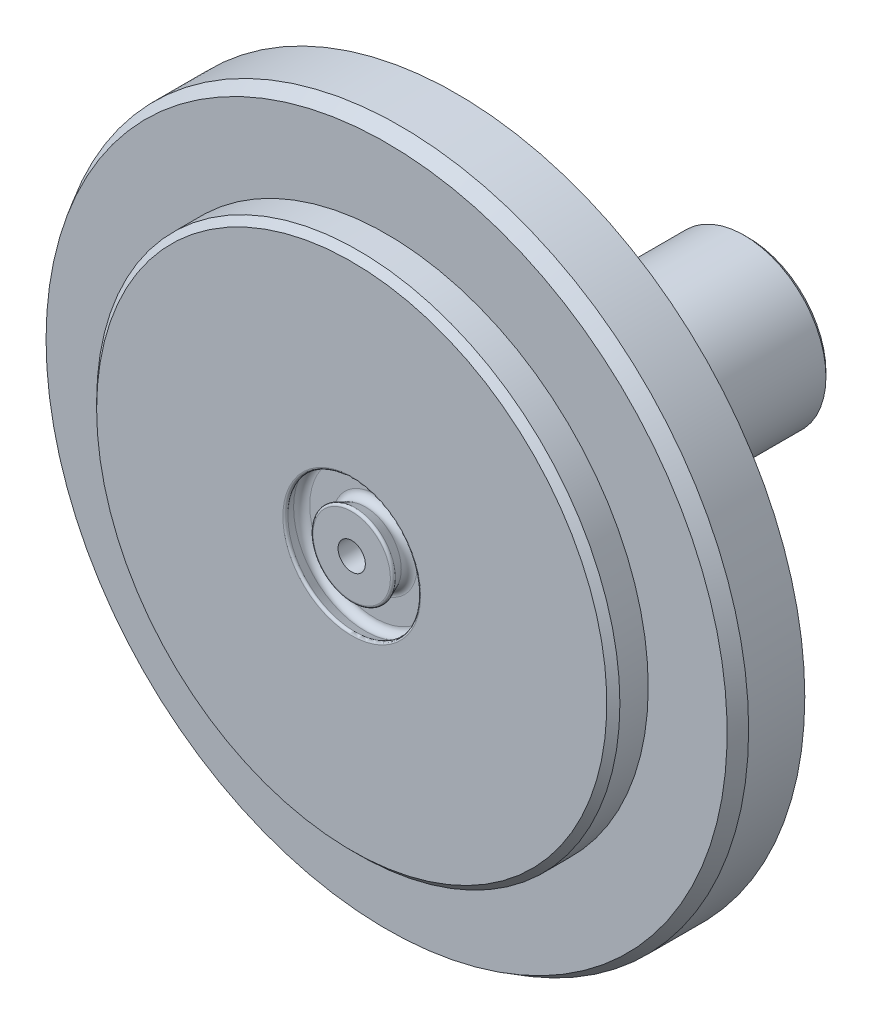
ISO-10303-21;
HEADER;
FILE_DESCRIPTION(('STEP AP214'),'2;1');
FILE_NAME('part.step','',(''),(''),'','','');
FILE_SCHEMA(('AUTOMOTIVE_DESIGN { 1 0 10303 214 1 1 1 1 }'));
ENDSEC;
DATA;
#1=APPLICATION_CONTEXT('core data for automotive mechanical design processes');
#2=APPLICATION_PROTOCOL_DEFINITION('international standard','automotive_design',2000,#1);
#3=PRODUCT_CONTEXT('',#1,'mechanical');
#4=PRODUCT('Part','Part','',(#3));
#5=PRODUCT_RELATED_PRODUCT_CATEGORY('part','',(#4));
#6=PRODUCT_DEFINITION_FORMATION('','',#4);
#7=PRODUCT_DEFINITION_CONTEXT('part definition',#1,'design');
#8=PRODUCT_DEFINITION('design','',#6,#7);
#9=PRODUCT_DEFINITION_SHAPE('','',#8);
#10=(LENGTH_UNIT() NAMED_UNIT(*) SI_UNIT(.MILLI.,.METRE.));
#11=(NAMED_UNIT(*) PLANE_ANGLE_UNIT() SI_UNIT($,.RADIAN.));
#12=(NAMED_UNIT(*) SI_UNIT($,.STERADIAN.) SOLID_ANGLE_UNIT());
#13=UNCERTAINTY_MEASURE_WITH_UNIT(LENGTH_MEASURE(1.E-05),#10,'distance_accuracy_value','');
#14=(GEOMETRIC_REPRESENTATION_CONTEXT(3) GLOBAL_UNCERTAINTY_ASSIGNED_CONTEXT((#13)) GLOBAL_UNIT_ASSIGNED_CONTEXT((#10,
#11,#12)) REPRESENTATION_CONTEXT('',''));
#15=CARTESIAN_POINT('',(0.,0.,0.));
#16=DIRECTION('',(0.,0.,1.));
#17=DIRECTION('',(1.,0.,0.));
#18=AXIS2_PLACEMENT_3D('',#15,#16,#17);
#19=CARTESIAN_POINT('',(0.,0.,-22.098));
#20=DIRECTION('',(0.,0.,1.));
#21=DIRECTION('',(1.,0.,0.));
#22=AXIS2_PLACEMENT_3D('',#19,#20,#21);
#23=CYLINDRICAL_SURFACE('',#22,4.7625);
#24=CARTESIAN_POINT('',(0.,0.,-3.048));
#25=DIRECTION('',(0.,0.,-1.));
#26=DIRECTION('',(-1.,0.,0.));
#27=AXIS2_PLACEMENT_3D('',#24,#25,#26);
#28=CIRCLE('',#27,4.7625);
#29=CARTESIAN_POINT('',(4.7625,0.,-3.048));
#30=VERTEX_POINT('',#29);
#31=EDGE_CURVE('E159',#30,#30,#28,.T.);
#32=CARTESIAN_POINT('',(0.,0.,-9.906));
#33=DIRECTION('',(0.,0.,-1.));
#34=DIRECTION('',(-1.,0.,0.));
#35=AXIS2_PLACEMENT_3D('',#32,#33,#34);
#36=CIRCLE('',#35,4.7625);
#37=CARTESIAN_POINT('',(4.7625,0.,-9.906));
#38=VERTEX_POINT('',#37);
#39=EDGE_CURVE('E134',#38,#38,#36,.T.);
#40=CARTESIAN_POINT('',(4.7625,0.,-3.048));
#41=CARTESIAN_POINT('',(4.7625,0.,-3.1194375));
#42=CARTESIAN_POINT('',(4.7625,0.,-3.190875));
#43=CARTESIAN_POINT('',(4.7625,0.,-3.33375));
#44=CARTESIAN_POINT('',(4.7625,0.,-3.4051875));
#45=CARTESIAN_POINT('',(4.7625,0.,-3.5480625));
#46=CARTESIAN_POINT('',(4.7625,0.,-3.6195));
#47=CARTESIAN_POINT('',(4.7625,0.,-3.76237499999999));
#48=CARTESIAN_POINT('',(4.7625,0.,-3.8338125));
#49=CARTESIAN_POINT('',(4.7625,0.,-3.9766875));
#50=CARTESIAN_POINT('',(4.7625,0.,-4.048125));
#51=CARTESIAN_POINT('',(4.7625,0.,-4.191));
#52=CARTESIAN_POINT('',(4.7625,0.,-4.2624375));
#53=CARTESIAN_POINT('',(4.7625,0.,-4.4053125));
#54=CARTESIAN_POINT('',(4.7625,0.,-4.47675));
#55=CARTESIAN_POINT('',(4.7625,0.,-4.619625));
#56=CARTESIAN_POINT('',(4.7625,0.,-4.6910625));
#57=CARTESIAN_POINT('',(4.7625,0.,-4.8339375));
#58=CARTESIAN_POINT('',(4.7625,0.,-4.905375));
#59=CARTESIAN_POINT('',(4.7625,0.,-5.04825));
#60=CARTESIAN_POINT('',(4.7625,0.,-5.1196875));
#61=CARTESIAN_POINT('',(4.7625,0.,-5.2625625));
#62=CARTESIAN_POINT('',(4.7625,0.,-5.334));
#63=CARTESIAN_POINT('',(4.7625,0.,-5.476875));
#64=CARTESIAN_POINT('',(4.7625,0.,-5.5483125));
#65=CARTESIAN_POINT('',(4.7625,0.,-5.6911875));
#66=CARTESIAN_POINT('',(4.7625,0.,-5.762625));
#67=CARTESIAN_POINT('',(4.7625,0.,-5.9055));
#68=CARTESIAN_POINT('',(4.7625,0.,-5.9769375));
#69=CARTESIAN_POINT('',(4.7625,0.,-6.1198125));
#70=CARTESIAN_POINT('',(4.7625,0.,-6.19125));
#71=CARTESIAN_POINT('',(4.7625,0.,-6.334125));
#72=CARTESIAN_POINT('',(4.7625,0.,-6.4055625));
#73=CARTESIAN_POINT('',(4.7625,0.,-6.5484375));
#74=CARTESIAN_POINT('',(4.7625,0.,-6.619875));
#75=CARTESIAN_POINT('',(4.7625,0.,-6.76275));
#76=CARTESIAN_POINT('',(4.7625,0.,-6.8341875));
#77=CARTESIAN_POINT('',(4.7625,0.,-6.9770625));
#78=CARTESIAN_POINT('',(4.7625,0.,-7.0485));
#79=CARTESIAN_POINT('',(4.7625,0.,-7.191375));
#80=CARTESIAN_POINT('',(4.7625,0.,-7.2628125));
#81=CARTESIAN_POINT('',(4.7625,0.,-7.4056875));
#82=CARTESIAN_POINT('',(4.7625,0.,-7.477125));
#83=CARTESIAN_POINT('',(4.7625,0.,-7.62));
#84=CARTESIAN_POINT('',(4.7625,0.,-7.6914375));
#85=CARTESIAN_POINT('',(4.7625,0.,-7.8343125));
#86=CARTESIAN_POINT('',(4.7625,0.,-7.90575));
#87=CARTESIAN_POINT('',(4.7625,0.,-8.048625));
#88=CARTESIAN_POINT('',(4.7625,0.,-8.1200625));
#89=CARTESIAN_POINT('',(4.7625,0.,-8.2629375));
#90=CARTESIAN_POINT('',(4.7625,0.,-8.334375));
#91=CARTESIAN_POINT('',(4.7625,0.,-8.47725));
#92=CARTESIAN_POINT('',(4.7625,0.,-8.5486875));
#93=CARTESIAN_POINT('',(4.7625,0.,-8.6915625));
#94=CARTESIAN_POINT('',(4.7625,0.,-8.763));
#95=CARTESIAN_POINT('',(4.7625,0.,-8.905875));
#96=CARTESIAN_POINT('',(4.7625,0.,-8.9773125));
#97=CARTESIAN_POINT('',(4.7625,0.,-9.1201875));
#98=CARTESIAN_POINT('',(4.7625,0.,-9.191625));
#99=CARTESIAN_POINT('',(4.7625,0.,-9.3345));
#100=CARTESIAN_POINT('',(4.7625,0.,-9.4059375));
#101=CARTESIAN_POINT('',(4.7625,0.,-9.5488125));
#102=CARTESIAN_POINT('',(4.7625,0.,-9.62025));
#103=CARTESIAN_POINT('',(4.7625,0.,-9.763125));
#104=CARTESIAN_POINT('',(4.7625,0.,-9.8345625));
#105=CARTESIAN_POINT('',(4.7625,0.,-9.906));
#106=B_SPLINE_CURVE_WITH_KNOTS('',3,(#40,#41,#42,#43,#44,#45,#46,#47,#48,#49,#50,#51,#52,#53,
#54,#55,#56,#57,#58,#59,#60,#61,#62,#63,#64,#65,#66,#67,#68,#69,#70,#71,#72,#73,#74,#75,#76,#77,
#78,#79,#80,#81,#82,#83,#84,#85,#86,#87,#88,#89,#90,#91,#92,#93,#94,#95,#96,#97,#98,#99,#100,
#101,#102,#103,#104,#105),.UNSPECIFIED.,.F.,.F.,(4,2,2,2,2,2,2,2,2,2,2,2,2,2,2,2,2,2,2,2,2,2,2,
2,2,2,2,2,2,2,2,2,4),(0.,0.214312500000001,0.428625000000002,0.642937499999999,0.85725,
1.0715625,1.285875,1.5001875,1.7145,1.9288125,2.143125,2.3574375,2.57175,2.7860625,3.000375,
3.2146875,3.429,3.6433125,3.857625,4.0719375,4.28625,4.5005625,4.714875,4.9291875,5.1435,
5.3578125,5.572125,5.7864375,6.00075,6.2150625,6.429375,6.6436875,6.858),.UNSPECIFIED.);
#107=EDGE_CURVE('BSEAM95',#30,#38,#106,.T.);
#108=ORIENTED_EDGE('',*,*,#31,.T.);
#109=ORIENTED_EDGE('',*,*,#39,.F.);
#110=ORIENTED_EDGE('',*,*,#107,.T.);
#111=ORIENTED_EDGE('',*,*,#107,.F.);
#112=EDGE_LOOP('',(#108,#110,#109,#111));
#113=FACE_BOUND('',#112,.T.);
#114=ADVANCED_FACE('F95',(#113),#23,.T.);
#115=CARTESIAN_POINT('',(0.,0.,-21.844));
#116=DIRECTION('',(0.,0.,-1.));
#117=DIRECTION('',(-1.,0.,0.));
#118=AXIS2_PLACEMENT_3D('',#115,#116,#117);
#119=CIRCLE('',#118,4.7625);
#120=CARTESIAN_POINT('',(4.7625,0.,-21.844));
#121=VERTEX_POINT('',#120);
#122=EDGE_CURVE('E127',#121,#121,#119,.F.);
#123=CARTESIAN_POINT('',(0.,0.,-10.922));
#124=DIRECTION('',(0.,0.,1.));
#125=DIRECTION('',(1.,0.,0.));
#126=AXIS2_PLACEMENT_3D('',#123,#124,#125);
#127=CIRCLE('',#126,4.7625);
#128=CARTESIAN_POINT('',(4.7625,0.,-10.922));
#129=VERTEX_POINT('',#128);
#130=EDGE_CURVE('E138',#129,#129,#127,.T.);
#131=CARTESIAN_POINT('',(4.7625,0.,-21.844));
#132=CARTESIAN_POINT('',(4.7625,0.,-21.7302291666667));
#133=CARTESIAN_POINT('',(4.7625,0.,-21.6164583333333));
#134=CARTESIAN_POINT('',(4.7625,0.,-21.3889166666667));
#135=CARTESIAN_POINT('',(4.7625,0.,-21.2751458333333));
#136=CARTESIAN_POINT('',(4.7625,0.,-21.0476041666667));
#137=CARTESIAN_POINT('',(4.7625,0.,-20.9338333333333));
#138=CARTESIAN_POINT('',(4.7625,0.,-20.7062916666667));
#139=CARTESIAN_POINT('',(4.7625,0.,-20.5925208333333));
#140=CARTESIAN_POINT('',(4.7625,0.,-20.3649791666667));
#141=CARTESIAN_POINT('',(4.7625,0.,-20.2512083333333));
#142=CARTESIAN_POINT('',(4.7625,0.,-20.0236666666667));
#143=CARTESIAN_POINT('',(4.7625,0.,-19.9098958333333));
#144=CARTESIAN_POINT('',(4.7625,0.,-19.6823541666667));
#145=CARTESIAN_POINT('',(4.7625,0.,-19.5685833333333));
#146=CARTESIAN_POINT('',(4.7625,0.,-19.3410416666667));
#147=CARTESIAN_POINT('',(4.7625,0.,-19.2272708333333));
#148=CARTESIAN_POINT('',(4.7625,0.,-18.9997291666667));
#149=CARTESIAN_POINT('',(4.7625,0.,-18.8859583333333));
#150=CARTESIAN_POINT('',(4.7625,0.,-18.6584166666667));
#151=CARTESIAN_POINT('',(4.7625,0.,-18.5446458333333));
#152=CARTESIAN_POINT('',(4.7625,0.,-18.3171041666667));
#153=CARTESIAN_POINT('',(4.7625,0.,-18.2033333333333));
#154=CARTESIAN_POINT('',(4.7625,0.,-17.9757916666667));
#155=CARTESIAN_POINT('',(4.7625,0.,-17.8620208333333));
#156=CARTESIAN_POINT('',(4.7625,0.,-17.6344791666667));
#157=CARTESIAN_POINT('',(4.7625,0.,-17.5207083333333));
#158=CARTESIAN_POINT('',(4.7625,0.,-17.2931666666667));
#159=CARTESIAN_POINT('',(4.7625,0.,-17.1793958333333));
#160=CARTESIAN_POINT('',(4.7625,0.,-16.9518541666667));
#161=CARTESIAN_POINT('',(4.7625,0.,-16.8380833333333));
#162=CARTESIAN_POINT('',(4.7625,0.,-16.6105416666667));
#163=CARTESIAN_POINT('',(4.7625,0.,-16.4967708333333));
#164=CARTESIAN_POINT('',(4.7625,0.,-16.2692291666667));
#165=CARTESIAN_POINT('',(4.7625,0.,-16.1554583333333));
#166=CARTESIAN_POINT('',(4.7625,0.,-15.9279166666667));
#167=CARTESIAN_POINT('',(4.7625,0.,-15.8141458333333));
#168=CARTESIAN_POINT('',(4.7625,0.,-15.5866041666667));
#169=CARTESIAN_POINT('',(4.7625,0.,-15.4728333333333));
#170=CARTESIAN_POINT('',(4.7625,0.,-15.2452916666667));
#171=CARTESIAN_POINT('',(4.7625,0.,-15.1315208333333));
#172=CARTESIAN_POINT('',(4.7625,0.,-14.9039791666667));
#173=CARTESIAN_POINT('',(4.7625,0.,-14.7902083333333));
#174=CARTESIAN_POINT('',(4.7625,0.,-14.5626666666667));
#175=CARTESIAN_POINT('',(4.7625,0.,-14.4488958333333));
#176=CARTESIAN_POINT('',(4.7625,0.,-14.2213541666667));
#177=CARTESIAN_POINT('',(4.7625,0.,-14.1075833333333));
#178=CARTESIAN_POINT('',(4.7625,0.,-13.8800416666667));
#179=CARTESIAN_POINT('',(4.7625,0.,-13.7662708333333));
#180=CARTESIAN_POINT('',(4.7625,0.,-13.5387291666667));
#181=CARTESIAN_POINT('',(4.7625,0.,-13.4249583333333));
#182=CARTESIAN_POINT('',(4.7625,0.,-13.1974166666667));
#183=CARTESIAN_POINT('',(4.7625,0.,-13.0836458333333));
#184=CARTESIAN_POINT('',(4.7625,0.,-12.8561041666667));
#185=CARTESIAN_POINT('',(4.7625,0.,-12.7423333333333));
#186=CARTESIAN_POINT('',(4.7625,0.,-12.5147916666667));
#187=CARTESIAN_POINT('',(4.7625,0.,-12.4010208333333));
#188=CARTESIAN_POINT('',(4.7625,0.,-12.1734791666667));
#189=CARTESIAN_POINT('',(4.7625,0.,-12.0597083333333));
#190=CARTESIAN_POINT('',(4.7625,0.,-11.8321666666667));
#191=CARTESIAN_POINT('',(4.7625,0.,-11.7183958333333));
#192=CARTESIAN_POINT('',(4.7625,0.,-11.4908541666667));
#193=CARTESIAN_POINT('',(4.7625,0.,-11.3770833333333));
#194=CARTESIAN_POINT('',(4.7625,0.,-11.1495416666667));
#195=CARTESIAN_POINT('',(4.7625,0.,-11.0357708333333));
#196=CARTESIAN_POINT('',(4.7625,0.,-10.922));
#197=B_SPLINE_CURVE_WITH_KNOTS('',3,(#131,#132,#133,#134,#135,#136,#137,#138,#139,#140,#141,
#142,#143,#144,#145,#146,#147,#148,#149,#150,#151,#152,#153,#154,#155,#156,#157,#158,#159,#160,
#161,#162,#163,#164,#165,#166,#167,#168,#169,#170,#171,#172,#173,#174,#175,#176,#177,#178,#179,
#180,#181,#182,#183,#184,#185,#186,#187,#188,#189,#190,#191,#192,#193,#194,#195,#196),
.UNSPECIFIED.,.F.,.F.,(4,2,2,2,2,2,2,2,2,2,2,2,2,2,2,2,2,2,2,2,2,2,2,2,2,2,2,2,2,2,2,2,4),(0.,
0.3413125,0.682624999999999,1.0239375,1.36525,1.7065625,2.047875,2.3891875,2.7305,3.0718125,
3.413125,3.7544375,4.09575,4.4370625,4.77837499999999,5.1196875,5.461,5.8023125,6.143625,
6.4849375,6.82625,7.1675625,7.50887499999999,7.85018749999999,8.19149999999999,8.53281249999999,
8.87412499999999,9.21543749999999,9.55674999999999,9.89806249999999,10.239375,10.5806875,
10.922),.UNSPECIFIED.);
#198=EDGE_CURVE('BSEAM204',#121,#129,#197,.T.);
#199=ORIENTED_EDGE('',*,*,#122,.T.);
#200=ORIENTED_EDGE('',*,*,#130,.F.);
#201=ORIENTED_EDGE('',*,*,#198,.T.);
#202=ORIENTED_EDGE('',*,*,#198,.F.);
#203=EDGE_LOOP('',(#199,#201,#200,#202));
#204=FACE_BOUND('',#203,.T.);
#205=ADVANCED_FACE('F204',(#204),#23,.T.);
#206=CARTESIAN_POINT('',(0.,0.,-22.098));
#207=DIRECTION('',(0.,0.,-1.));
#208=DIRECTION('',(-1.,0.,0.));
#209=AXIS2_PLACEMENT_3D('',#206,#207,#208);
#210=PLANE('',#209);
#211=CARTESIAN_POINT('',(0.,0.,-22.098));
#212=DIRECTION('',(0.,0.,-1.));
#213=DIRECTION('',(-1.,0.,0.));
#214=AXIS2_PLACEMENT_3D('',#211,#212,#213);
#215=CIRCLE('',#214,4.50850000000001);
#216=CARTESIAN_POINT('',(4.50850000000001,0.,-22.098));
#217=VERTEX_POINT('',#216);
#218=EDGE_CURVE('E130',#217,#217,#215,.T.);
#219=ORIENTED_EDGE('',*,*,#218,.T.);
#220=EDGE_LOOP('',(#219));
#221=FACE_BOUND('',#220,.T.);
#222=CARTESIAN_POINT('',(0.,0.,-22.0979999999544));
#223=DIRECTION('',(0.,0.,-1.));
#224=DIRECTION('',(-1.,0.,0.));
#225=AXIS2_PLACEMENT_3D('',#222,#223,#224);
#226=CIRCLE('',#225,3.42899703);
#227=CARTESIAN_POINT('',(-3.42899703,0.,-22.0979999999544));
#228=VERTEX_POINT('',#227);
#229=EDGE_CURVE('E174',#228,#228,#226,.T.);
#230=ORIENTED_EDGE('',*,*,#229,.F.);
#231=EDGE_LOOP('',(#230));
#232=FACE_BOUND('',#231,.T.);
#233=ADVANCED_FACE('F206',(#221,#232),#210,.T.);
#234=CARTESIAN_POINT('',(0.,0.,-3.048));
#235=DIRECTION('',(0.,0.,-1.));
#236=DIRECTION('',(-1.,0.,0.));
#237=AXIS2_PLACEMENT_3D('',#234,#235,#236);
#238=PLANE('',#237);
#239=CARTESIAN_POINT('',(0.,0.,-3.048));
#240=DIRECTION('',(0.,0.,-1.));
#241=DIRECTION('',(-1.,0.,0.));
#242=AXIS2_PLACEMENT_3D('',#239,#240,#241);
#243=CIRCLE('',#242,15.3035);
#244=CARTESIAN_POINT('',(0.,-15.3035,-3.048));
#245=VERTEX_POINT('',#244);
#246=EDGE_CURVE('E133',#245,#245,#243,.F.);
#247=ORIENTED_EDGE('',*,*,#246,.F.);
#248=EDGE_LOOP('',(#247));
#249=FACE_BOUND('',#248,.T.);
#250=ORIENTED_EDGE('',*,*,#31,.F.);
#251=EDGE_LOOP('',(#250));
#252=FACE_BOUND('',#251,.T.);
#253=ADVANCED_FACE('F213',(#249,#252),#238,.T.);
#254=CARTESIAN_POINT('',(0.,0.,1.016));
#255=DIRECTION('',(0.,0.,-1.));
#256=DIRECTION('',(-1.,0.,0.));
#257=AXIS2_PLACEMENT_3D('',#254,#255,#256);
#258=CYLINDRICAL_SURFACE('',#257,15.24);
#259=CARTESIAN_POINT('',(0.,0.,0.634999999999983));
#260=DIRECTION('',(0.,0.,1.));
#261=DIRECTION('',(1.,0.,0.));
#262=AXIS2_PLACEMENT_3D('',#259,#260,#261);
#263=CIRCLE('',#262,15.24);
#264=CARTESIAN_POINT('',(-15.24,0.,0.634999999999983));
#265=VERTEX_POINT('',#264);
#266=EDGE_CURVE('E121',#265,#265,#263,.F.);
#267=CARTESIAN_POINT('',(0.,0.,-1.016));
#268=DIRECTION('',(0.,0.,-1.));
#269=DIRECTION('',(-1.,0.,0.));
#270=AXIS2_PLACEMENT_3D('',#267,#268,#269);
#271=CIRCLE('',#270,15.24);
#272=CARTESIAN_POINT('',(-15.24,0.,-1.016));
#273=VERTEX_POINT('',#272);
#274=EDGE_CURVE('E156',#273,#273,#271,.T.);
#275=CARTESIAN_POINT('',(-15.24,0.,0.634999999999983));
#276=CARTESIAN_POINT('',(-15.24,0.,0.617802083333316));
#277=CARTESIAN_POINT('',(-15.24,0.,0.60060416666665));
#278=CARTESIAN_POINT('',(-15.24,0.,0.566208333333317));
#279=CARTESIAN_POINT('',(-15.24,0.,0.54901041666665));
#280=CARTESIAN_POINT('',(-15.24,0.,0.514614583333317));
#281=CARTESIAN_POINT('',(-15.24,0.,0.497416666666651));
#282=CARTESIAN_POINT('',(-15.24,0.,0.463020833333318));
#283=CARTESIAN_POINT('',(-15.24,0.,0.445822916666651));
#284=CARTESIAN_POINT('',(-15.24,0.,0.411427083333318));
#285=CARTESIAN_POINT('',(-15.24,0.,0.394229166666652));
#286=CARTESIAN_POINT('',(-15.24,0.,0.359833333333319));
#287=CARTESIAN_POINT('',(-15.24,0.,0.342635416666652));
#288=CARTESIAN_POINT('',(-15.24,0.,0.308239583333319));
#289=CARTESIAN_POINT('',(-15.24,0.,0.291041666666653));
#290=CARTESIAN_POINT('',(-15.24,0.,0.25664583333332));
#291=CARTESIAN_POINT('',(-15.24,0.,0.239447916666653));
#292=CARTESIAN_POINT('',(-15.24,0.,0.20505208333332));
#293=CARTESIAN_POINT('',(-15.24,0.,0.187854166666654));
#294=CARTESIAN_POINT('',(-15.24,0.,0.15345833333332));
#295=CARTESIAN_POINT('',(-15.24,0.,0.136260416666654));
#296=CARTESIAN_POINT('',(-15.24,0.,0.101864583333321));
#297=CARTESIAN_POINT('',(-15.24,0.,0.0846666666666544));
#298=CARTESIAN_POINT('',(-15.24,0.,0.0502708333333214));
#299=CARTESIAN_POINT('',(-15.24,0.,0.0330729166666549));
#300=CARTESIAN_POINT('',(-15.24,0.,-0.00132291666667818));
#301=CARTESIAN_POINT('',(-15.24,0.,-0.0185208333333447));
#302=CARTESIAN_POINT('',(-15.24,0.,-0.0529166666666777));
#303=CARTESIAN_POINT('',(-15.24,0.,-0.0701145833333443));
#304=CARTESIAN_POINT('',(-15.24,0.,-0.104510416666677));
#305=CARTESIAN_POINT('',(-15.24,0.,-0.121708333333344));
#306=CARTESIAN_POINT('',(-15.24,0.,-0.156104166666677));
#307=CARTESIAN_POINT('',(-15.24,0.,-0.173302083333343));
#308=CARTESIAN_POINT('',(-15.24,0.,-0.207697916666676));
#309=CARTESIAN_POINT('',(-15.24,0.,-0.224895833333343));
#310=CARTESIAN_POINT('',(-15.24,0.,-0.259291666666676));
#311=CARTESIAN_POINT('',(-15.24,0.,-0.276489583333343));
#312=CARTESIAN_POINT('',(-15.24,0.,-0.310885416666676));
#313=CARTESIAN_POINT('',(-15.24,0.,-0.328083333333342));
#314=CARTESIAN_POINT('',(-15.24,0.,-0.362479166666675));
#315=CARTESIAN_POINT('',(-15.24,0.,-0.379677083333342));
#316=CARTESIAN_POINT('',(-15.24,0.,-0.414072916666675));
#317=CARTESIAN_POINT('',(-15.24,0.,-0.431270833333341));
#318=CARTESIAN_POINT('',(-15.24,0.,-0.465666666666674));
#319=CARTESIAN_POINT('',(-15.24,0.,-0.482864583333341));
#320=CARTESIAN_POINT('',(-15.24,0.,-0.517260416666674));
#321=CARTESIAN_POINT('',(-15.24,0.,-0.53445833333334));
#322=CARTESIAN_POINT('',(-15.24,0.,-0.568854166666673));
#323=CARTESIAN_POINT('',(-15.24,0.,-0.58605208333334));
#324=CARTESIAN_POINT('',(-15.24,0.,-0.620447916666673));
#325=CARTESIAN_POINT('',(-15.24,0.,-0.637645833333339));
#326=CARTESIAN_POINT('',(-15.24,0.,-0.672041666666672));
#327=CARTESIAN_POINT('',(-15.24,0.,-0.689239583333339));
#328=CARTESIAN_POINT('',(-15.24,0.,-0.723635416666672));
#329=CARTESIAN_POINT('',(-15.24,0.,-0.740833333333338));
#330=CARTESIAN_POINT('',(-15.24,0.,-0.775229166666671));
#331=CARTESIAN_POINT('',(-15.24,0.,-0.792427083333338));
#332=CARTESIAN_POINT('',(-15.24,0.,-0.826822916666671));
#333=CARTESIAN_POINT('',(-15.24,0.,-0.844020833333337));
#334=CARTESIAN_POINT('',(-15.24,0.,-0.878416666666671));
#335=CARTESIAN_POINT('',(-15.24,0.,-0.895614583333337));
#336=CARTESIAN_POINT('',(-15.24,0.,-0.93001041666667));
#337=CARTESIAN_POINT('',(-15.24,0.,-0.947208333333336));
#338=CARTESIAN_POINT('',(-15.24,0.,-0.981604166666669));
#339=CARTESIAN_POINT('',(-15.24,0.,-0.998802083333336));
#340=CARTESIAN_POINT('',(-15.24,0.,-1.016));
#341=B_SPLINE_CURVE_WITH_KNOTS('',3,(#275,#276,#277,#278,#279,#280,#281,#282,#283,#284,#285,
#286,#287,#288,#289,#290,#291,#292,#293,#294,#295,#296,#297,#298,#299,#300,#301,#302,#303,#304,
#305,#306,#307,#308,#309,#310,#311,#312,#313,#314,#315,#316,#317,#318,#319,#320,#321,#322,#323,
#324,#325,#326,#327,#328,#329,#330,#331,#332,#333,#334,#335,#336,#337,#338,#339,#340),
.UNSPECIFIED.,.F.,.F.,(4,2,2,2,2,2,2,2,2,2,2,2,2,2,2,2,2,2,2,2,2,2,2,2,2,2,2,2,2,2,2,2,4),(0.,
0.0515937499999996,0.103187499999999,0.154781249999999,0.206374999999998,0.257968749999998,
0.309562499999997,0.361156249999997,0.412749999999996,0.464343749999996,0.515937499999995,
0.567531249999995,0.619124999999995,0.670718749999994,0.722312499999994,0.773906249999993,
0.825499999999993,0.877093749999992,0.928687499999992,0.980281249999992,1.03187499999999,
1.08346874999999,1.13506249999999,1.18665624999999,1.23824999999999,1.28984374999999,
1.34143749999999,1.39303124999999,1.44462499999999,1.49621874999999,1.54781249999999,
1.59940624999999,1.65099999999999),.UNSPECIFIED.);
#342=EDGE_CURVE('BSEAM97',#265,#273,#341,.T.);
#343=ORIENTED_EDGE('',*,*,#266,.T.);
#344=ORIENTED_EDGE('',*,*,#274,.F.);
#345=ORIENTED_EDGE('',*,*,#342,.T.);
#346=ORIENTED_EDGE('',*,*,#342,.F.);
#347=EDGE_LOOP('',(#343,#345,#344,#346));
#348=FACE_BOUND('',#347,.T.);
#349=ADVANCED_FACE('F97',(#348),#258,.T.);
#350=CARTESIAN_POINT('',(0.,0.,1.016));
#351=DIRECTION('',(0.,0.,1.));
#352=DIRECTION('',(1.,0.,0.));
#353=AXIS2_PLACEMENT_3D('',#350,#351,#352);
#354=PLANE('',#353);
#355=CARTESIAN_POINT('',(0.,0.,1.016));
#356=DIRECTION('',(0.,0.,1.));
#357=DIRECTION('',(1.,0.,0.));
#358=AXIS2_PLACEMENT_3D('',#355,#356,#357);
#359=CIRCLE('',#358,4.01167711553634);
#360=CARTESIAN_POINT('',(4.01167711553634,0.,1.016));
#361=VERTEX_POINT('',#360);
#362=EDGE_CURVE('E110',#361,#361,#359,.F.);
#363=ORIENTED_EDGE('',*,*,#362,.T.);
#364=EDGE_LOOP('',(#363));
#365=FACE_BOUND('',#364,.T.);
#366=CARTESIAN_POINT('',(0.,0.,1.016));
#367=DIRECTION('',(0.,0.,1.));
#368=DIRECTION('',(1.,0.,0.));
#369=AXIS2_PLACEMENT_3D('',#366,#367,#368);
#370=CIRCLE('',#369,14.859);
#371=CARTESIAN_POINT('',(-14.859,0.,1.016));
#372=VERTEX_POINT('',#371);
#373=EDGE_CURVE('E124',#372,#372,#370,.T.);
#374=ORIENTED_EDGE('',*,*,#373,.T.);
#375=EDGE_LOOP('',(#374));
#376=FACE_BOUND('',#375,.T.);
#377=ADVANCED_FACE('F249',(#365,#376),#354,.T.);
#378=CARTESIAN_POINT('',(0.,0.,0.0761999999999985));
#379=DIRECTION('',(0.,0.,-1.));
#380=DIRECTION('',(-1.,0.,0.));
#381=AXIS2_PLACEMENT_3D('',#378,#379,#380);
#382=TOROIDAL_SURFACE('',#381,3.78968,0.4064);
#383=CARTESIAN_POINT('',(0.,0.,0.241497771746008));
#384=DIRECTION('',(0.,0.,-1.));
#385=DIRECTION('',(-1.,0.,0.));
#386=AXIS2_PLACEMENT_3D('',#383,#384,#385);
#387=CIRCLE('',#386,4.16094487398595);
#388=CARTESIAN_POINT('',(-4.16094487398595,0.,0.241497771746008));
#389=VERTEX_POINT('',#388);
#390=EDGE_CURVE('E153',#389,#389,#387,.T.);
#391=ORIENTED_EDGE('',*,*,#390,.F.);
#392=EDGE_LOOP('',(#391));
#393=FACE_BOUND('',#392,.T.);
#394=CARTESIAN_POINT('',(0.,0.,-0.330200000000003));
#395=DIRECTION('',(0.,0.,-1.));
#396=DIRECTION('',(-1.,0.,0.));
#397=AXIS2_PLACEMENT_3D('',#394,#395,#396);
#398=CIRCLE('',#397,3.78968);
#399=CARTESIAN_POINT('',(-3.78968,0.,-0.330200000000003));
#400=VERTEX_POINT('',#399);
#401=EDGE_CURVE('E144',#400,#400,#398,.T.);
#402=ORIENTED_EDGE('',*,*,#401,.T.);
#403=EDGE_LOOP('',(#402));
#404=FACE_BOUND('',#403,.T.);
#405=ADVANCED_FACE('F246',(#393,#404),#382,.F.);
#406=CARTESIAN_POINT('',(0.,2.45872,-0.330200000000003));
#407=DIRECTION('',(0.,0.,-1.));
#408=DIRECTION('',(-1.,0.,0.));
#409=AXIS2_PLACEMENT_3D('',#406,#407,#408);
#410=PLANE('',#409);
#411=ORIENTED_EDGE('',*,*,#401,.F.);
#412=EDGE_LOOP('',(#411));
#413=FACE_BOUND('',#412,.T.);
#414=CARTESIAN_POINT('',(0.,0.,-0.330200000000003));
#415=DIRECTION('',(0.,0.,-1.));
#416=DIRECTION('',(-1.,0.,0.));
#417=AXIS2_PLACEMENT_3D('',#414,#415,#416);
#418=CIRCLE('',#417,2.45872);
#419=CARTESIAN_POINT('',(-2.45872,0.,-0.330200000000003));
#420=VERTEX_POINT('',#419);
#421=EDGE_CURVE('E147',#420,#420,#418,.T.);
#422=ORIENTED_EDGE('',*,*,#421,.T.);
#423=EDGE_LOOP('',(#422));
#424=FACE_BOUND('',#423,.T.);
#425=ADVANCED_FACE('F242',(#413,#424),#410,.F.);
#426=CARTESIAN_POINT('',(0.,0.,0.0660400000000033));
#427=DIRECTION('',(0.,0.,-1.));
#428=DIRECTION('',(-1.,0.,0.));
#429=AXIS2_PLACEMENT_3D('',#426,#427,#428);
#430=TOROIDAL_SURFACE('',#429,2.45872,0.39624);
#431=ORIENTED_EDGE('',*,*,#421,.F.);
#432=EDGE_LOOP('',(#431));
#433=FACE_BOUND('',#432,.T.);
#434=CARTESIAN_POINT('',(0.,0.,0.227205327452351));
#435=DIRECTION('',(0.,0.,-1.));
#436=DIRECTION('',(-1.,0.,0.));
#437=AXIS2_PLACEMENT_3D('',#434,#435,#436);
#438=CIRCLE('',#437,2.0967367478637);
#439=CARTESIAN_POINT('',(2.09673674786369,0.,0.227205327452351));
#440=VERTEX_POINT('',#439);
#441=EDGE_CURVE('E150',#440,#440,#438,.T.);
#442=ORIENTED_EDGE('',*,*,#441,.T.);
#443=EDGE_LOOP('',(#442));
#444=FACE_BOUND('',#443,.T.);
#445=ADVANCED_FACE('F239',(#433,#444),#430,.F.);
#446=CARTESIAN_POINT('',(0.,0.,1.016));
#447=DIRECTION('',(0.,0.,1.));
#448=DIRECTION('',(1.,0.,0.));
#449=AXIS2_PLACEMENT_3D('',#446,#447,#448);
#450=CONICAL_SURFACE('',#449,2.44793076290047,0.418879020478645);
#451=CARTESIAN_POINT('',(0.,0.,0.837344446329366));
#452=DIRECTION('',(0.,0.,1.));
#453=DIRECTION('',(1.,0.,0.));
#454=AXIS2_PLACEMENT_3D('',#451,#452,#453);
#455=CIRCLE('',#454,2.36838818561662);
#456=CARTESIAN_POINT('',(2.36838818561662,0.,0.837344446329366));
#457=VERTEX_POINT('',#456);
#458=EDGE_CURVE('E102',#457,#457,#455,.F.);
#459=CARTESIAN_POINT('',(2.36838818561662,0.,0.837344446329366));
#460=CARTESIAN_POINT('',(2.36555848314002,0.,0.830988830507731));
#461=CARTESIAN_POINT('',(2.36272878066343,0.,0.824633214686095));
#462=CARTESIAN_POINT('',(2.35706937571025,0.,0.811921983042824));
#463=CARTESIAN_POINT('',(2.35423967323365,0.,0.805566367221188));
#464=CARTESIAN_POINT('',(2.34858026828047,0.,0.792855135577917));
#465=CARTESIAN_POINT('',(2.34575056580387,0.,0.786499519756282));
#466=CARTESIAN_POINT('',(2.34009116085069,0.,0.77378828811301));
#467=CARTESIAN_POINT('',(2.3372614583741,0.,0.767432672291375));
#468=CARTESIAN_POINT('',(2.33160205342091,0.,0.754721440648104));
#469=CARTESIAN_POINT('',(2.32877235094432,0.,0.748365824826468));
#470=CARTESIAN_POINT('',(2.32311294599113,0.,0.735654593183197));
#471=CARTESIAN_POINT('',(2.32028324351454,0.,0.729298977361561));
#472=CARTESIAN_POINT('',(2.31462383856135,0.,0.71658774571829));
#473=CARTESIAN_POINT('',(2.31179413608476,0.,0.710232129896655));
#474=CARTESIAN_POINT('',(2.30613473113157,0.,0.697520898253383));
#475=CARTESIAN_POINT('',(2.30330502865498,0.,0.691165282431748));
#476=CARTESIAN_POINT('',(2.29764562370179,0.,0.678454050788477));
#477=CARTESIAN_POINT('',(2.2948159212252,0.,0.672098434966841));
#478=CARTESIAN_POINT('',(2.28915651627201,0.,0.65938720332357));
#479=CARTESIAN_POINT('',(2.28632681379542,0.,0.653031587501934));
#480=CARTESIAN_POINT('',(2.28066740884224,0.,0.640320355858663));
#481=CARTESIAN_POINT('',(2.27783770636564,0.,0.633964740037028));
#482=CARTESIAN_POINT('',(2.27217830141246,0.,0.621253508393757));
#483=CARTESIAN_POINT('',(2.26934859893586,0.,0.614897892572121));
#484=CARTESIAN_POINT('',(2.26368919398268,0.,0.60218666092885));
#485=CARTESIAN_POINT('',(2.26085949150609,0.,0.595831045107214));
#486=CARTESIAN_POINT('',(2.2552000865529,0.,0.583119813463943));
#487=CARTESIAN_POINT('',(2.25237038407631,0.,0.576764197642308));
#488=CARTESIAN_POINT('',(2.24671097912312,0.,0.564052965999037));
#489=CARTESIAN_POINT('',(2.24388127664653,0.,0.557697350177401));
#490=CARTESIAN_POINT('',(2.23822187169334,0.,0.54498611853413));
#491=CARTESIAN_POINT('',(2.23539216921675,0.,0.538630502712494));
#492=CARTESIAN_POINT('',(2.22973276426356,0.,0.525919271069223));
#493=CARTESIAN_POINT('',(2.22690306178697,0.,0.519563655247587));
#494=CARTESIAN_POINT('',(2.22124365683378,0.,0.506852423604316));
#495=CARTESIAN_POINT('',(2.21841395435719,0.,0.500496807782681));
#496=CARTESIAN_POINT('',(2.212754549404,0.,0.487785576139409));
#497=CARTESIAN_POINT('',(2.20992484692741,0.,0.481429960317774));
#498=CARTESIAN_POINT('',(2.20426544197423,0.,0.468718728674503));
#499=CARTESIAN_POINT('',(2.20143573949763,0.,0.462363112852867));
#500=CARTESIAN_POINT('',(2.19577633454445,0.,0.449651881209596));
#501=CARTESIAN_POINT('',(2.19294663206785,0.,0.44329626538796));
#502=CARTESIAN_POINT('',(2.18728722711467,0.,0.430585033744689));
#503=CARTESIAN_POINT('',(2.18445752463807,0.,0.424229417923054));
#504=CARTESIAN_POINT('',(2.17879811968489,0.,0.411518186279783));
#505=CARTESIAN_POINT('',(2.1759684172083,0.,0.405162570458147));
#506=CARTESIAN_POINT('',(2.17030901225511,0.,0.392451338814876));
#507=CARTESIAN_POINT('',(2.16747930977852,0.,0.38609572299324));
#508=CARTESIAN_POINT('',(2.16181990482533,0.,0.373384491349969));
#509=CARTESIAN_POINT('',(2.15899020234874,0.,0.367028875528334));
#510=CARTESIAN_POINT('',(2.15333079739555,0.,0.354317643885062));
#511=CARTESIAN_POINT('',(2.15050109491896,0.,0.347962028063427));
#512=CARTESIAN_POINT('',(2.14484168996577,0.,0.335250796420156));
#513=CARTESIAN_POINT('',(2.14201198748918,0.,0.32889518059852));
#514=CARTESIAN_POINT('',(2.13635258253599,0.,0.316183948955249));
#515=CARTESIAN_POINT('',(2.1335228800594,0.,0.309828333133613));
#516=CARTESIAN_POINT('',(2.12786347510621,0.,0.297117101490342));
#517=CARTESIAN_POINT('',(2.12503377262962,0.,0.290761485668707));
#518=CARTESIAN_POINT('',(2.11937436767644,0.,0.278050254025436));
#519=CARTESIAN_POINT('',(2.11654466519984,0.,0.2716946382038));
#520=CARTESIAN_POINT('',(2.11088526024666,0.,0.258983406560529));
#521=CARTESIAN_POINT('',(2.10805555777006,0.,0.252627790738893));
#522=CARTESIAN_POINT('',(2.10239615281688,0.,0.239916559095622));
#523=CARTESIAN_POINT('',(2.09956645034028,0.,0.233560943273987));
#524=CARTESIAN_POINT('',(2.09673674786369,0.,0.227205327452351));
#525=B_SPLINE_CURVE_WITH_KNOTS('',3,(#459,#460,#461,#462,#463,#464,#465,#466,#467,#468,#469,
#470,#471,#472,#473,#474,#475,#476,#477,#478,#479,#480,#481,#482,#483,#484,#485,#486,#487,#488,
#489,#490,#491,#492,#493,#494,#495,#496,#497,#498,#499,#500,#501,#502,#503,#504,#505,#506,#507,
#508,#509,#510,#511,#512,#513,#514,#515,#516,#517,#518,#519,#520,#521,#522,#523,#524),
.UNSPECIFIED.,.F.,.F.,(4,2,2,2,2,2,2,2,2,2,2,2,2,2,2,2,2,2,2,2,2,2,2,2,2,2,2,2,2,2,2,2,4),(0.,
0.0208712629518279,0.0417425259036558,0.0626137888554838,0.0834850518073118,0.10435631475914,
0.125227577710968,0.146098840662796,0.166970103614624,0.187841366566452,0.20871262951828,
0.229583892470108,0.250455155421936,0.271326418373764,0.292197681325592,0.31306894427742,
0.333940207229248,0.354811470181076,0.375682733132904,0.396553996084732,0.41742525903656,
0.438296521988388,0.459167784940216,0.480039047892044,0.500910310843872,0.5217815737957,
0.542652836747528,0.563524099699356,0.584395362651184,0.605266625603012,0.62613788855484,
0.647009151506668,0.667880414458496),.UNSPECIFIED.);
#526=EDGE_CURVE('BSEAM235',#457,#440,#525,.T.);
#527=ORIENTED_EDGE('',*,*,#458,.T.);
#528=ORIENTED_EDGE('',*,*,#441,.F.);
#529=ORIENTED_EDGE('',*,*,#526,.T.);
#530=ORIENTED_EDGE('',*,*,#526,.F.);
#531=EDGE_LOOP('',(#527,#529,#528,#530));
#532=FACE_BOUND('',#531,.T.);
#533=ADVANCED_FACE('F235',(#532),#450,.T.);
#534=CARTESIAN_POINT('',(0.,0.,0.241497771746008));
#535=DIRECTION('',(0.,0.,-1.));
#536=DIRECTION('',(-1.,0.,0.));
#537=AXIS2_PLACEMENT_3D('',#534,#535,#536);
#538=CONICAL_SURFACE('',#537,4.16094487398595,0.418879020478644);
#539=CARTESIAN_POINT('',(0.,0.,0.837344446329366));
#540=DIRECTION('',(0.,0.,-1.));
#541=DIRECTION('',(-1.,0.,0.));
#542=AXIS2_PLACEMENT_3D('',#539,#540,#541);
#543=CIRCLE('',#542,3.89565684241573);
#544=CARTESIAN_POINT('',(-3.89565684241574,0.,0.837344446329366));
#545=VERTEX_POINT('',#544);
#546=EDGE_CURVE('E106',#545,#545,#543,.F.);
#547=CARTESIAN_POINT('',(-3.89565684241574,0.,0.837344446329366));
#548=CARTESIAN_POINT('',(-3.89842025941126,0.,0.83113771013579));
#549=CARTESIAN_POINT('',(-3.90118367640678,0.,0.824930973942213));
#550=CARTESIAN_POINT('',(-3.90671051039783,0.,0.81251750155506));
#551=CARTESIAN_POINT('',(-3.90947392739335,0.,0.806310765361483));
#552=CARTESIAN_POINT('',(-3.9150007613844,0.,0.79389729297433));
#553=CARTESIAN_POINT('',(-3.91776417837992,0.,0.787690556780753));
#554=CARTESIAN_POINT('',(-3.92329101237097,0.,0.7752770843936));
#555=CARTESIAN_POINT('',(-3.92605442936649,0.,0.769070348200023));
#556=CARTESIAN_POINT('',(-3.93158126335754,0.,0.75665687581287));
#557=CARTESIAN_POINT('',(-3.93434468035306,0.,0.750450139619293));
#558=CARTESIAN_POINT('',(-3.93987151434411,0.,0.73803666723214));
#559=CARTESIAN_POINT('',(-3.94263493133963,0.,0.731829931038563));
#560=CARTESIAN_POINT('',(-3.94816176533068,0.,0.71941645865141));
#561=CARTESIAN_POINT('',(-3.9509251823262,0.,0.713209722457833));
#562=CARTESIAN_POINT('',(-3.95645201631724,0.,0.70079625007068));
#563=CARTESIAN_POINT('',(-3.95921543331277,0.,0.694589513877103));
#564=CARTESIAN_POINT('',(-3.96474226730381,0.,0.68217604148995));
#565=CARTESIAN_POINT('',(-3.96750568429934,0.,0.675969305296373));
#566=CARTESIAN_POINT('',(-3.97303251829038,0.,0.66355583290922));
#567=CARTESIAN_POINT('',(-3.97579593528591,0.,0.657349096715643));
#568=CARTESIAN_POINT('',(-3.98132276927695,0.,0.64493562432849));
#569=CARTESIAN_POINT('',(-3.98408618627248,0.,0.638728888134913));
#570=CARTESIAN_POINT('',(-3.98961302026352,0.,0.62631541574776));
#571=CARTESIAN_POINT('',(-3.99237643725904,0.,0.620108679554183));
#572=CARTESIAN_POINT('',(-3.99790327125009,0.,0.60769520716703));
#573=CARTESIAN_POINT('',(-4.00066668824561,0.,0.601488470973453));
#574=CARTESIAN_POINT('',(-4.00619352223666,0.,0.5890749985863));
#575=CARTESIAN_POINT('',(-4.00895693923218,0.,0.582868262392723));
#576=CARTESIAN_POINT('',(-4.01448377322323,0.,0.57045479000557));
#577=CARTESIAN_POINT('',(-4.01724719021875,0.,0.564248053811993));
#578=CARTESIAN_POINT('',(-4.0227740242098,0.,0.55183458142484));
#579=CARTESIAN_POINT('',(-4.02553744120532,0.,0.545627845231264));
#580=CARTESIAN_POINT('',(-4.03106427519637,0.,0.53321437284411));
#581=CARTESIAN_POINT('',(-4.03382769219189,0.,0.527007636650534));
#582=CARTESIAN_POINT('',(-4.03935452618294,0.,0.51459416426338));
#583=CARTESIAN_POINT('',(-4.04211794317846,0.,0.508387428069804));
#584=CARTESIAN_POINT('',(-4.04764477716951,0.,0.49597395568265));
#585=CARTESIAN_POINT('',(-4.05040819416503,0.,0.489767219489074));
#586=CARTESIAN_POINT('',(-4.05593502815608,0.,0.47735374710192));
#587=CARTESIAN_POINT('',(-4.0586984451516,0.,0.471147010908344));
#588=CARTESIAN_POINT('',(-4.06422527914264,0.,0.45873353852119));
#589=CARTESIAN_POINT('',(-4.06698869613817,0.,0.452526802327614));
#590=CARTESIAN_POINT('',(-4.07251553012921,0.,0.44011332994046));
#591=CARTESIAN_POINT('',(-4.07527894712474,0.,0.433906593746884));
#592=CARTESIAN_POINT('',(-4.08080578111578,0.,0.421493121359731));
#593=CARTESIAN_POINT('',(-4.08356919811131,0.,0.415286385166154));
#594=CARTESIAN_POINT('',(-4.08909603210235,0.,0.402872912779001));
#595=CARTESIAN_POINT('',(-4.09185944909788,0.,0.396666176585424));
#596=CARTESIAN_POINT('',(-4.09738628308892,0.,0.384252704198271));
#597=CARTESIAN_POINT('',(-4.10014970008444,0.,0.378045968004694));
#598=CARTESIAN_POINT('',(-4.10567653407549,0.,0.365632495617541));
#599=CARTESIAN_POINT('',(-4.10843995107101,0.,0.359425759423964));
#600=CARTESIAN_POINT('',(-4.11396678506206,0.,0.347012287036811));
#601=CARTESIAN_POINT('',(-4.11673020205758,0.,0.340805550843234));
#602=CARTESIAN_POINT('',(-4.12225703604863,0.,0.328392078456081));
#603=CARTESIAN_POINT('',(-4.12502045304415,0.,0.322185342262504));
#604=CARTESIAN_POINT('',(-4.1305472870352,0.,0.309771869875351));
#605=CARTESIAN_POINT('',(-4.13331070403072,0.,0.303565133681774));
#606=CARTESIAN_POINT('',(-4.13883753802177,0.,0.291151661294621));
#607=CARTESIAN_POINT('',(-4.14160095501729,0.,0.284944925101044));
#608=CARTESIAN_POINT('',(-4.14712778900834,0.,0.272531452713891));
#609=CARTESIAN_POINT('',(-4.14989120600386,0.,0.266324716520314));
#610=CARTESIAN_POINT('',(-4.15541803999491,0.,0.253911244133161));
#611=CARTESIAN_POINT('',(-4.15818145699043,0.,0.247704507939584));
#612=CARTESIAN_POINT('',(-4.16094487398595,0.,0.241497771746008));
#613=B_SPLINE_CURVE_WITH_KNOTS('',3,(#547,#548,#549,#550,#551,#552,#553,#554,#555,#556,#557,
#558,#559,#560,#561,#562,#563,#564,#565,#566,#567,#568,#569,#570,#571,#572,#573,#574,#575,#576,
#577,#578,#579,#580,#581,#582,#583,#584,#585,#586,#587,#588,#589,#590,#591,#592,#593,#594,#595,
#596,#597,#598,#599,#600,#601,#602,#603,#604,#605,#606,#607,#608,#609,#610,#611,#612),
.UNSPECIFIED.,.F.,.F.,(4,2,2,2,2,2,2,2,2,2,2,2,2,2,2,2,2,2,2,2,2,2,2,2,2,2,2,2,2,2,2,2,4),(0.,
0.0203823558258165,0.0407647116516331,0.0611470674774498,0.0815294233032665,0.101911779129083,
0.1222941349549,0.142676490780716,0.163058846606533,0.18344120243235,0.203823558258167,
0.224205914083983,0.2445882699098,0.264970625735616,0.285352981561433,0.30573533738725,
0.326117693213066,0.346500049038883,0.3668824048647,0.387264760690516,0.407647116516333,
0.428029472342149,0.448411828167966,0.468794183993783,0.4891765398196,0.509558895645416,
0.529941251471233,0.550323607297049,0.570705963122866,0.591088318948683,0.611470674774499,
0.631853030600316,0.652235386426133),.UNSPECIFIED.);
#614=EDGE_CURVE('BSEAM232',#545,#389,#613,.T.);
#615=ORIENTED_EDGE('',*,*,#546,.T.);
#616=ORIENTED_EDGE('',*,*,#390,.T.);
#617=ORIENTED_EDGE('',*,*,#614,.T.);
#618=ORIENTED_EDGE('',*,*,#614,.F.);
#619=EDGE_LOOP('',(#615,#617,#616,#618));
#620=FACE_BOUND('',#619,.T.);
#621=ADVANCED_FACE('F232',(#620),#538,.F.);
#622=CARTESIAN_POINT('',(0.,0.,1.016));
#623=DIRECTION('',(0.,0.,1.));
#624=DIRECTION('',(1.,0.,0.));
#625=AXIS2_PLACEMENT_3D('',#622,#623,#624);
#626=CIRCLE('',#625,2.25236791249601);
#627=CARTESIAN_POINT('',(2.25236791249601,0.,1.016));
#628=VERTEX_POINT('',#627);
#629=EDGE_CURVE('E11',#628,#628,#626,.T.);
#630=ORIENTED_EDGE('',*,*,#629,.T.);
#631=EDGE_LOOP('',(#630));
#632=FACE_BOUND('',#631,.T.);
#633=CARTESIAN_POINT('',(0.,0.,1.016));
#634=DIRECTION('',(0.,0.,-1.));
#635=DIRECTION('',(0.,1.,0.));
#636=AXIS2_PLACEMENT_3D('',#633,#634,#635);
#637=CIRCLE('',#636,0.793749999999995);
#638=CARTESIAN_POINT('',(0.,0.79374999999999,1.016));
#639=VERTEX_POINT('',#638);
#640=EDGE_CURVE('E180',#639,#639,#637,.T.);
#641=ORIENTED_EDGE('',*,*,#640,.T.);
#642=EDGE_LOOP('',(#641));
#643=FACE_BOUND('',#642,.T.);
#644=ADVANCED_FACE('F223',(#632,#643),#354,.T.);
#645=CARTESIAN_POINT('',(0.,0.,-1.016));
#646=DIRECTION('',(0.,0.,-1.));
#647=DIRECTION('',(-1.,0.,0.));
#648=AXIS2_PLACEMENT_3D('',#645,#646,#647);
#649=PLANE('',#648);
#650=CARTESIAN_POINT('',(0.,0.,-1.016));
#651=DIRECTION('',(0.,0.,-1.));
#652=DIRECTION('',(-1.,0.,0.));
#653=AXIS2_PLACEMENT_3D('',#650,#651,#652);
#654=CIRCLE('',#653,19.8363282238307);
#655=CARTESIAN_POINT('',(-19.8363282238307,0.,-1.016));
#656=VERTEX_POINT('',#655);
#657=EDGE_CURVE('E115',#656,#656,#654,.F.);
#658=ORIENTED_EDGE('',*,*,#657,.T.);
#659=EDGE_LOOP('',(#658));
#660=FACE_BOUND('',#659,.T.);
#661=ORIENTED_EDGE('',*,*,#274,.T.);
#662=EDGE_LOOP('',(#661));
#663=FACE_BOUND('',#662,.T.);
#664=ADVANCED_FACE('F219',(#660,#663),#649,.F.);
#665=CARTESIAN_POINT('',(0.,0.,-3.048));
#666=DIRECTION('',(0.,0.,1.));
#667=DIRECTION('',(1.,0.,0.));
#668=AXIS2_PLACEMENT_3D('',#665,#666,#667);
#669=CYLINDRICAL_SURFACE('',#668,20.2946);
#670=CARTESIAN_POINT('',(0.,0.,-1.80975000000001));
#671=DIRECTION('',(0.,0.,-1.));
#672=DIRECTION('',(-1.,0.,0.));
#673=AXIS2_PLACEMENT_3D('',#670,#671,#672);
#674=CIRCLE('',#673,20.2946);
#675=CARTESIAN_POINT('',(20.2946,0.,-1.80975000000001));
#676=VERTEX_POINT('',#675);
#677=EDGE_CURVE('E118',#676,#676,#674,.T.);
#678=CARTESIAN_POINT('',(0.,0.,-5.08));
#679=DIRECTION('',(0.,0.,-1.));
#680=DIRECTION('',(0.,1.,0.));
#681=AXIS2_PLACEMENT_3D('',#678,#679,#680);
#682=CIRCLE('',#681,20.2946);
#683=CARTESIAN_POINT('',(20.2946,0.,-5.08));
#684=VERTEX_POINT('',#683);
#685=EDGE_CURVE('E183',#684,#684,#682,.T.);
#686=CARTESIAN_POINT('',(20.2946,0.,-1.80975000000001));
#687=CARTESIAN_POINT('',(20.2946,0.,-1.84381510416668));
#688=CARTESIAN_POINT('',(20.2946,0.,-1.87788020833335));
#689=CARTESIAN_POINT('',(20.2946,0.,-1.94601041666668));
#690=CARTESIAN_POINT('',(20.2946,0.,-1.98007552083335));
#691=CARTESIAN_POINT('',(20.2946,0.,-2.04820572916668));
#692=CARTESIAN_POINT('',(20.2946,0.,-2.08227083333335));
#693=CARTESIAN_POINT('',(20.2946,0.,-2.15040104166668));
#694=CARTESIAN_POINT('',(20.2946,0.,-2.18446614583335));
#695=CARTESIAN_POINT('',(20.2946,0.,-2.25259635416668));
#696=CARTESIAN_POINT('',(20.2946,0.,-2.28666145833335));
#697=CARTESIAN_POINT('',(20.2946,0.,-2.35479166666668));
#698=CARTESIAN_POINT('',(20.2946,0.,-2.38885677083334));
#699=CARTESIAN_POINT('',(20.2946,0.,-2.45698697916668));
#700=CARTESIAN_POINT('',(20.2946,0.,-2.49105208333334));
#701=CARTESIAN_POINT('',(20.2946,0.,-2.55918229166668));
#702=CARTESIAN_POINT('',(20.2946,0.,-2.59324739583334));
#703=CARTESIAN_POINT('',(20.2946,0.,-2.66137760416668));
#704=CARTESIAN_POINT('',(20.2946,0.,-2.69544270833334));
#705=CARTESIAN_POINT('',(20.2946,0.,-2.76357291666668));
#706=CARTESIAN_POINT('',(20.2946,0.,-2.79763802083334));
#707=CARTESIAN_POINT('',(20.2946,0.,-2.86576822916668));
#708=CARTESIAN_POINT('',(20.2946,0.,-2.89983333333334));
#709=CARTESIAN_POINT('',(20.2946,0.,-2.96796354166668));
#710=CARTESIAN_POINT('',(20.2946,0.,-3.00202864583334));
#711=CARTESIAN_POINT('',(20.2946,0.,-3.07015885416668));
#712=CARTESIAN_POINT('',(20.2946,0.,-3.10422395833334));
#713=CARTESIAN_POINT('',(20.2946,0.,-3.17235416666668));
#714=CARTESIAN_POINT('',(20.2946,0.,-3.20641927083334));
#715=CARTESIAN_POINT('',(20.2946,0.,-3.27454947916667));
#716=CARTESIAN_POINT('',(20.2946,0.,-3.30861458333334));
#717=CARTESIAN_POINT('',(20.2946,0.,-3.37674479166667));
#718=CARTESIAN_POINT('',(20.2946,0.,-3.41080989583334));
#719=CARTESIAN_POINT('',(20.2946,0.,-3.47894010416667));
#720=CARTESIAN_POINT('',(20.2946,0.,-3.51300520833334));
#721=CARTESIAN_POINT('',(20.2946,0.,-3.58113541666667));
#722=CARTESIAN_POINT('',(20.2946,0.,-3.61520052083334));
#723=CARTESIAN_POINT('',(20.2946,0.,-3.68333072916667));
#724=CARTESIAN_POINT('',(20.2946,0.,-3.71739583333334));
#725=CARTESIAN_POINT('',(20.2946,0.,-3.78552604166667));
#726=CARTESIAN_POINT('',(20.2946,0.,-3.81959114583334));
#727=CARTESIAN_POINT('',(20.2946,0.,-3.88772135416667));
#728=CARTESIAN_POINT('',(20.2946,0.,-3.92178645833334));
#729=CARTESIAN_POINT('',(20.2946,0.,-3.98991666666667));
#730=CARTESIAN_POINT('',(20.2946,0.,-4.02398177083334));
#731=CARTESIAN_POINT('',(20.2946,0.,-4.09211197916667));
#732=CARTESIAN_POINT('',(20.2946,0.,-4.12617708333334));
#733=CARTESIAN_POINT('',(20.2946,0.,-4.19430729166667));
#734=CARTESIAN_POINT('',(20.2946,0.,-4.22837239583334));
#735=CARTESIAN_POINT('',(20.2946,0.,-4.29650260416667));
#736=CARTESIAN_POINT('',(20.2946,0.,-4.33056770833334));
#737=CARTESIAN_POINT('',(20.2946,0.,-4.39869791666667));
#738=CARTESIAN_POINT('',(20.2946,0.,-4.43276302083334));
#739=CARTESIAN_POINT('',(20.2946,0.,-4.50089322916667));
#740=CARTESIAN_POINT('',(20.2946,0.,-4.53495833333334));
#741=CARTESIAN_POINT('',(20.2946,0.,-4.60308854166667));
#742=CARTESIAN_POINT('',(20.2946,0.,-4.63715364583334));
#743=CARTESIAN_POINT('',(20.2946,0.,-4.70528385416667));
#744=CARTESIAN_POINT('',(20.2946,0.,-4.73934895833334));
#745=CARTESIAN_POINT('',(20.2946,0.,-4.80747916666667));
#746=CARTESIAN_POINT('',(20.2946,0.,-4.84154427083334));
#747=CARTESIAN_POINT('',(20.2946,0.,-4.90967447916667));
#748=CARTESIAN_POINT('',(20.2946,0.,-4.94373958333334));
#749=CARTESIAN_POINT('',(20.2946,0.,-5.01186979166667));
#750=CARTESIAN_POINT('',(20.2946,0.,-5.04593489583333));
#751=CARTESIAN_POINT('',(20.2946,0.,-5.08));
#752=B_SPLINE_CURVE_WITH_KNOTS('',3,(#686,#687,#688,#689,#690,#691,#692,#693,#694,#695,#696,
#697,#698,#699,#700,#701,#702,#703,#704,#705,#706,#707,#708,#709,#710,#711,#712,#713,#714,#715,
#716,#717,#718,#719,#720,#721,#722,#723,#724,#725,#726,#727,#728,#729,#730,#731,#732,#733,#734,
#735,#736,#737,#738,#739,#740,#741,#742,#743,#744,#745,#746,#747,#748,#749,#750,#751),
.UNSPECIFIED.,.F.,.F.,(4,2,2,2,2,2,2,2,2,2,2,2,2,2,2,2,2,2,2,2,2,2,2,2,2,2,2,2,2,2,2,2,4),(0.,
0.1021953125,0.204390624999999,0.306585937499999,0.408781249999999,0.510976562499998,
0.613171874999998,0.715367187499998,0.817562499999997,0.919757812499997,1.021953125,
1.1241484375,1.22634375,1.3285390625,1.430734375,1.53292968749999,1.63512499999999,
1.73732031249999,1.83951562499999,1.94171093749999,2.04390624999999,2.14610156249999,
2.24829687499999,2.35049218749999,2.45268749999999,2.55488281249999,2.65707812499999,
2.75927343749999,2.86146874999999,2.96366406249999,3.06585937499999,3.16805468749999,
3.27024999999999),.UNSPECIFIED.);
#753=EDGE_CURVE('BSEAM222',#676,#684,#752,.T.);
#754=ORIENTED_EDGE('',*,*,#677,.T.);
#755=ORIENTED_EDGE('',*,*,#685,.F.);
#756=ORIENTED_EDGE('',*,*,#753,.T.);
#757=ORIENTED_EDGE('',*,*,#753,.F.);
#758=EDGE_LOOP('',(#754,#756,#755,#757));
#759=FACE_BOUND('',#758,.T.);
#760=ADVANCED_FACE('F222',(#759),#669,.T.);
#761=CARTESIAN_POINT('',(0.,0.,-14.1605068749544));
#762=DIRECTION('',(0.,0.,-1.));
#763=DIRECTION('',(-1.,0.,0.));
#764=AXIS2_PLACEMENT_3D('',#761,#762,#763);
#765=PLANE('',#764);
#766=CARTESIAN_POINT('',(0.,0.,-14.1605068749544));
#767=DIRECTION('',(0.,0.,-1.));
#768=DIRECTION('',(0.,1.,0.));
#769=AXIS2_PLACEMENT_3D('',#766,#767,#768);
#770=CIRCLE('',#769,0.793749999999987);
#771=CARTESIAN_POINT('',(0.,0.793749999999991,-14.1605068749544));
#772=VERTEX_POINT('',#771);
#773=EDGE_CURVE('E177',#772,#772,#770,.T.);
#774=ORIENTED_EDGE('',*,*,#773,.F.);
#775=EDGE_LOOP('',(#774));
#776=FACE_BOUND('',#775,.T.);
#777=CARTESIAN_POINT('',(0.,0.,-14.1605068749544));
#778=DIRECTION('',(0.,0.,-1.));
#779=DIRECTION('',(-1.,0.,0.));
#780=AXIS2_PLACEMENT_3D('',#777,#778,#779);
#781=CIRCLE('',#780,2.70509765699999);
#782=CARTESIAN_POINT('',(-2.705097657,0.,-14.1605068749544));
#783=VERTEX_POINT('',#782);
#784=EDGE_CURVE('E162',#783,#783,#781,.T.);
#785=ORIENTED_EDGE('',*,*,#784,.T.);
#786=EDGE_LOOP('',(#785));
#787=FACE_BOUND('',#786,.T.);
#788=ADVANCED_FACE('F230',(#776,#787),#765,.T.);
#789=CARTESIAN_POINT('',(0.,0.,-22.0979999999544));
#790=DIRECTION('',(0.,0.,-1.));
#791=DIRECTION('',(-1.,0.,0.));
#792=AXIS2_PLACEMENT_3D('',#789,#790,#791);
#793=CYLINDRICAL_SURFACE('',#792,2.705097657);
#794=CARTESIAN_POINT('',(0.,0.,-15.0672860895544));
#795=DIRECTION('',(0.,0.,-1.));
#796=DIRECTION('',(-1.,0.,0.));
#797=AXIS2_PLACEMENT_3D('',#794,#795,#796);
#798=CIRCLE('',#797,2.705097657);
#799=CARTESIAN_POINT('',(-2.705097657,0.,-15.0672860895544));
#800=VERTEX_POINT('',#799);
#801=EDGE_CURVE('E165',#800,#800,#798,.T.);
#802=CARTESIAN_POINT('',(-2.705097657,0.,-15.0672860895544));
#803=CARTESIAN_POINT('',(-2.705097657,0.,-15.0578404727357));
#804=CARTESIAN_POINT('',(-2.705097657,0.,-15.0483948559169));
#805=CARTESIAN_POINT('',(-2.705097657,0.,-15.0295036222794));
#806=CARTESIAN_POINT('',(-2.705097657,0.,-15.0200580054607));
#807=CARTESIAN_POINT('',(-2.705097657,0.,-15.0011667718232));
#808=CARTESIAN_POINT('',(-2.705097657,0.,-14.9917211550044));
#809=CARTESIAN_POINT('',(-2.705097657,0.,-14.9728299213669));
#810=CARTESIAN_POINT('',(-2.705097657,0.,-14.9633843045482));
#811=CARTESIAN_POINT('',(-2.705097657,0.,-14.9444930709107));
#812=CARTESIAN_POINT('',(-2.705097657,0.,-14.9350474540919));
#813=CARTESIAN_POINT('',(-2.705097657,0.,-14.9161562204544));
#814=CARTESIAN_POINT('',(-2.705097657,0.,-14.9067106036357));
#815=CARTESIAN_POINT('',(-2.705097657,0.,-14.8878193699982));
#816=CARTESIAN_POINT('',(-2.705097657,0.,-14.8783737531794));
#817=CARTESIAN_POINT('',(-2.705097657,0.,-14.8594825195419));
#818=CARTESIAN_POINT('',(-2.705097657,0.,-14.8500369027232));
#819=CARTESIAN_POINT('',(-2.705097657,0.,-14.8311456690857));
#820=CARTESIAN_POINT('',(-2.705097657,0.,-14.8217000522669));
#821=CARTESIAN_POINT('',(-2.705097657,0.,-14.8028088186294));
#822=CARTESIAN_POINT('',(-2.705097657,0.,-14.7933632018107));
#823=CARTESIAN_POINT('',(-2.705097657,0.,-14.7744719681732));
#824=CARTESIAN_POINT('',(-2.705097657,0.,-14.7650263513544));
#825=CARTESIAN_POINT('',(-2.705097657,0.,-14.7461351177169));
#826=CARTESIAN_POINT('',(-2.705097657,0.,-14.7366895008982));
#827=CARTESIAN_POINT('',(-2.705097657,0.,-14.7177982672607));
#828=CARTESIAN_POINT('',(-2.705097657,0.,-14.7083526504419));
#829=CARTESIAN_POINT('',(-2.705097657,0.,-14.6894614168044));
#830=CARTESIAN_POINT('',(-2.705097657,0.,-14.6800157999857));
#831=CARTESIAN_POINT('',(-2.705097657,0.,-14.6611245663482));
#832=CARTESIAN_POINT('',(-2.705097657,0.,-14.6516789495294));
#833=CARTESIAN_POINT('',(-2.705097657,0.,-14.6327877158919));
#834=CARTESIAN_POINT('',(-2.705097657,0.,-14.6233420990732));
#835=CARTESIAN_POINT('',(-2.705097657,0.,-14.6044508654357));
#836=CARTESIAN_POINT('',(-2.705097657,0.,-14.5950052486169));
#837=CARTESIAN_POINT('',(-2.705097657,0.,-14.5761140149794));
#838=CARTESIAN_POINT('',(-2.705097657,0.,-14.5666683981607));
#839=CARTESIAN_POINT('',(-2.705097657,0.,-14.5477771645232));
#840=CARTESIAN_POINT('',(-2.705097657,0.,-14.5383315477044));
#841=CARTESIAN_POINT('',(-2.705097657,0.,-14.5194403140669));
#842=CARTESIAN_POINT('',(-2.705097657,0.,-14.5099946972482));
#843=CARTESIAN_POINT('',(-2.705097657,0.,-14.4911034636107));
#844=CARTESIAN_POINT('',(-2.705097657,0.,-14.4816578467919));
#845=CARTESIAN_POINT('',(-2.705097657,0.,-14.4627666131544));
#846=CARTESIAN_POINT('',(-2.705097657,0.,-14.4533209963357));
#847=CARTESIAN_POINT('',(-2.705097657,0.,-14.4344297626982));
#848=CARTESIAN_POINT('',(-2.705097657,0.,-14.4249841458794));
#849=CARTESIAN_POINT('',(-2.705097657,0.,-14.4060929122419));
#850=CARTESIAN_POINT('',(-2.705097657,0.,-14.3966472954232));
#851=CARTESIAN_POINT('',(-2.705097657,0.,-14.3777560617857));
#852=CARTESIAN_POINT('',(-2.705097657,0.,-14.3683104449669));
#853=CARTESIAN_POINT('',(-2.705097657,0.,-14.3494192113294));
#854=CARTESIAN_POINT('',(-2.705097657,0.,-14.3399735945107));
#855=CARTESIAN_POINT('',(-2.705097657,0.,-14.3210823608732));
#856=CARTESIAN_POINT('',(-2.705097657,0.,-14.3116367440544));
#857=CARTESIAN_POINT('',(-2.705097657,0.,-14.2927455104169));
#858=CARTESIAN_POINT('',(-2.705097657,0.,-14.2832998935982));
#859=CARTESIAN_POINT('',(-2.705097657,0.,-14.2644086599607));
#860=CARTESIAN_POINT('',(-2.705097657,0.,-14.2549630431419));
#861=CARTESIAN_POINT('',(-2.705097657,0.,-14.2360718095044));
#862=CARTESIAN_POINT('',(-2.705097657,0.,-14.2266261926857));
#863=CARTESIAN_POINT('',(-2.705097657,0.,-14.2077349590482));
#864=CARTESIAN_POINT('',(-2.705097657,0.,-14.1982893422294));
#865=CARTESIAN_POINT('',(-2.705097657,0.,-14.1793981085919));
#866=CARTESIAN_POINT('',(-2.705097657,0.,-14.1699524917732));
#867=CARTESIAN_POINT('',(-2.705097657,0.,-14.1605068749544));
#868=B_SPLINE_CURVE_WITH_KNOTS('',3,(#802,#803,#804,#805,#806,#807,#808,#809,#810,#811,#812,
#813,#814,#815,#816,#817,#818,#819,#820,#821,#822,#823,#824,#825,#826,#827,#828,#829,#830,#831,
#832,#833,#834,#835,#836,#837,#838,#839,#840,#841,#842,#843,#844,#845,#846,#847,#848,#849,#850,
#851,#852,#853,#854,#855,#856,#857,#858,#859,#860,#861,#862,#863,#864,#865,#866,#867),
.UNSPECIFIED.,.F.,.F.,(4,2,2,2,2,2,2,2,2,2,2,2,2,2,2,2,2,2,2,2,2,2,2,2,2,2,2,2,2,2,2,2,4),(0.,
0.0283368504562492,0.0566737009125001,0.085010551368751,0.113347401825,0.141684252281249,
0.1700211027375,0.198357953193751,0.22669480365,0.255031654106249,0.2833685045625,
0.311705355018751,0.340042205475,0.368379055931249,0.3967159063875,0.425052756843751,
0.4533896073,0.48172645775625,0.5100633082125,0.538400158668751,0.566737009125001,
0.59507385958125,0.623410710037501,0.651747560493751,0.680084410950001,0.70842126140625,
0.736758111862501,0.765094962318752,0.793431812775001,0.821768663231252,0.850105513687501,
0.87844236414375,0.906779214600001),.UNSPECIFIED.);
#869=EDGE_CURVE('BSEAM274',#800,#783,#868,.T.);
#870=ORIENTED_EDGE('',*,*,#801,.T.);
#871=ORIENTED_EDGE('',*,*,#784,.F.);
#872=ORIENTED_EDGE('',*,*,#869,.T.);
#873=ORIENTED_EDGE('',*,*,#869,.F.);
#874=EDGE_LOOP('',(#870,#872,#871,#873));
#875=FACE_BOUND('',#874,.T.);
#876=ADVANCED_FACE('F274',(#875),#793,.F.);
#877=CARTESIAN_POINT('',(2.705097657,0.,-15.0672860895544));
#878=DIRECTION('',(0.,0.,-1.));
#879=DIRECTION('',(-1.,0.,0.));
#880=AXIS2_PLACEMENT_3D('',#877,#878,#879);
#881=PLANE('',#880);
#882=CARTESIAN_POINT('',(0.,0.,-15.0672860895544));
#883=DIRECTION('',(0.,0.,-1.));
#884=DIRECTION('',(-1.,0.,0.));
#885=AXIS2_PLACEMENT_3D('',#882,#883,#884);
#886=CIRCLE('',#885,3.17499725);
#887=CARTESIAN_POINT('',(-3.17499725,0.,-15.0672860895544));
#888=VERTEX_POINT('',#887);
#889=EDGE_CURVE('E168',#888,#888,#886,.T.);
#890=ORIENTED_EDGE('',*,*,#889,.T.);
#891=EDGE_LOOP('',(#890));
#892=FACE_BOUND('',#891,.T.);
#893=ORIENTED_EDGE('',*,*,#801,.F.);
#894=EDGE_LOOP('',(#893));
#895=FACE_BOUND('',#894,.T.);
#896=ADVANCED_FACE('F278',(#892,#895),#881,.T.);
#897=CARTESIAN_POINT('',(0.,0.,-22.0979999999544));
#898=DIRECTION('',(0.,0.,-1.));
#899=DIRECTION('',(-1.,0.,0.));
#900=AXIS2_PLACEMENT_3D('',#897,#898,#899);
#901=CYLINDRICAL_SURFACE('',#900,3.17499725);
#902=CARTESIAN_POINT('',(0.,0.,-21.4847905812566));
#903=DIRECTION('',(0.,0.,-1.));
#904=DIRECTION('',(-1.,0.,0.));
#905=AXIS2_PLACEMENT_3D('',#902,#903,#904);
#906=CIRCLE('',#905,3.17499725);
#907=CARTESIAN_POINT('',(-3.17499725,0.,-21.4847905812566));
#908=VERTEX_POINT('',#907);
#909=EDGE_CURVE('E171',#908,#908,#906,.T.);
#910=CARTESIAN_POINT('',(-3.17499725,0.,-21.4847905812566));
#911=CARTESIAN_POINT('',(-3.17499725,0.,-21.4179415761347));
#912=CARTESIAN_POINT('',(-3.17499725,0.,-21.3510925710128));
#913=CARTESIAN_POINT('',(-3.17499725,0.,-21.217394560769));
#914=CARTESIAN_POINT('',(-3.17499725,0.,-21.1505455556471));
#915=CARTESIAN_POINT('',(-3.17499725,0.,-21.0168475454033));
#916=CARTESIAN_POINT('',(-3.17499725,0.,-20.9499985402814));
#917=CARTESIAN_POINT('',(-3.17499725,0.,-20.8163005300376));
#918=CARTESIAN_POINT('',(-3.17499725,0.,-20.7494515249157));
#919=CARTESIAN_POINT('',(-3.17499725,0.,-20.6157535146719));
#920=CARTESIAN_POINT('',(-3.17499725,0.,-20.54890450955));
#921=CARTESIAN_POINT('',(-3.17499725,0.,-20.4152064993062));
#922=CARTESIAN_POINT('',(-3.17499725,0.,-20.3483574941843));
#923=CARTESIAN_POINT('',(-3.17499725,0.,-20.2146594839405));
#924=CARTESIAN_POINT('',(-3.17499725,0.,-20.1478104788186));
#925=CARTESIAN_POINT('',(-3.17499725,0.,-20.0141124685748));
#926=CARTESIAN_POINT('',(-3.17499725,0.,-19.9472634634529));
#927=CARTESIAN_POINT('',(-3.17499725,0.,-19.8135654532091));
#928=CARTESIAN_POINT('',(-3.17499725,0.,-19.7467164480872));
#929=CARTESIAN_POINT('',(-3.17499725,0.,-19.6130184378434));
#930=CARTESIAN_POINT('',(-3.17499725,0.,-19.5461694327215));
#931=CARTESIAN_POINT('',(-3.17499725,0.,-19.4124714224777));
#932=CARTESIAN_POINT('',(-3.17499725,0.,-19.3456224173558));
#933=CARTESIAN_POINT('',(-3.17499725,0.,-19.2119244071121));
#934=CARTESIAN_POINT('',(-3.17499725,0.,-19.1450754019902));
#935=CARTESIAN_POINT('',(-3.17499725,0.,-19.0113773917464));
#936=CARTESIAN_POINT('',(-3.17499725,0.,-18.9445283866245));
#937=CARTESIAN_POINT('',(-3.17499725,0.,-18.8108303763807));
#938=CARTESIAN_POINT('',(-3.17499725,0.,-18.7439813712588));
#939=CARTESIAN_POINT('',(-3.17499725,0.,-18.610283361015));
#940=CARTESIAN_POINT('',(-3.17499725,0.,-18.5434343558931));
#941=CARTESIAN_POINT('',(-3.17499725,0.,-18.4097363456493));
#942=CARTESIAN_POINT('',(-3.17499725,0.,-18.3428873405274));
#943=CARTESIAN_POINT('',(-3.17499725,0.,-18.2091893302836));
#944=CARTESIAN_POINT('',(-3.17499725,0.,-18.1423403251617));
#945=CARTESIAN_POINT('',(-3.17499725,0.,-18.0086423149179));
#946=CARTESIAN_POINT('',(-3.17499725,0.,-17.941793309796));
#947=CARTESIAN_POINT('',(-3.17499725,0.,-17.8080952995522));
#948=CARTESIAN_POINT('',(-3.17499725,0.,-17.7412462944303));
#949=CARTESIAN_POINT('',(-3.17499725,0.,-17.6075482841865));
#950=CARTESIAN_POINT('',(-3.17499725,0.,-17.5406992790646));
#951=CARTESIAN_POINT('',(-3.17499725,0.,-17.4070012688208));
#952=CARTESIAN_POINT('',(-3.17499725,0.,-17.3401522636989));
#953=CARTESIAN_POINT('',(-3.17499725,0.,-17.2064542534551));
#954=CARTESIAN_POINT('',(-3.17499725,0.,-17.1396052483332));
#955=CARTESIAN_POINT('',(-3.17499725,0.,-17.0059072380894));
#956=CARTESIAN_POINT('',(-3.17499725,0.,-16.9390582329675));
#957=CARTESIAN_POINT('',(-3.17499725,0.,-16.8053602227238));
#958=CARTESIAN_POINT('',(-3.17499725,0.,-16.7385112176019));
#959=CARTESIAN_POINT('',(-3.17499725,0.,-16.6048132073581));
#960=CARTESIAN_POINT('',(-3.17499725,0.,-16.5379642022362));
#961=CARTESIAN_POINT('',(-3.17499725,0.,-16.4042661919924));
#962=CARTESIAN_POINT('',(-3.17499725,0.,-16.3374171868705));
#963=CARTESIAN_POINT('',(-3.17499725,0.,-16.2037191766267));
#964=CARTESIAN_POINT('',(-3.17499725,0.,-16.1368701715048));
#965=CARTESIAN_POINT('',(-3.17499725,0.,-16.003172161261));
#966=CARTESIAN_POINT('',(-3.17499725,0.,-15.9363231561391));
#967=CARTESIAN_POINT('',(-3.17499725,0.,-15.8026251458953));
#968=CARTESIAN_POINT('',(-3.17499725,0.,-15.7357761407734));
#969=CARTESIAN_POINT('',(-3.17499725,0.,-15.6020781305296));
#970=CARTESIAN_POINT('',(-3.17499725,0.,-15.5352291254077));
#971=CARTESIAN_POINT('',(-3.17499725,0.,-15.4015311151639));
#972=CARTESIAN_POINT('',(-3.17499725,0.,-15.334682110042));
#973=CARTESIAN_POINT('',(-3.17499725,0.,-15.2009840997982));
#974=CARTESIAN_POINT('',(-3.17499725,0.,-15.1341350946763));
#975=CARTESIAN_POINT('',(-3.17499725,0.,-15.0672860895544));
#976=B_SPLINE_CURVE_WITH_KNOTS('',3,(#910,#911,#912,#913,#914,#915,#916,#917,#918,#919,#920,
#921,#922,#923,#924,#925,#926,#927,#928,#929,#930,#931,#932,#933,#934,#935,#936,#937,#938,#939,
#940,#941,#942,#943,#944,#945,#946,#947,#948,#949,#950,#951,#952,#953,#954,#955,#956,#957,#958,
#959,#960,#961,#962,#963,#964,#965,#966,#967,#968,#969,#970,#971,#972,#973,#974,#975),
.UNSPECIFIED.,.F.,.F.,(4,2,2,2,2,2,2,2,2,2,2,2,2,2,2,2,2,2,2,2,2,2,2,2,2,2,2,2,2,2,2,2,4),(0.,
0.20054701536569,0.40109403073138,0.601641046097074,0.802188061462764,1.00273507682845,
1.20328209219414,1.40382910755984,1.60437612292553,1.80492313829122,2.00547015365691,
2.2060171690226,2.40656418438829,2.60711119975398,2.80765821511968,3.00820523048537,
3.20875224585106,3.40929926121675,3.60984627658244,3.81039329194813,4.01094030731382,
4.21148732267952,4.41203433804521,4.6125813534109,4.81312836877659,5.01367538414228,
5.21422239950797,5.41476941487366,5.61531643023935,5.81586344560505,6.01641046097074,
6.21695747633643,6.41750449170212),.UNSPECIFIED.);
#977=EDGE_CURVE('BSEAM284',#908,#888,#976,.T.);
#978=ORIENTED_EDGE('',*,*,#909,.T.);
#979=ORIENTED_EDGE('',*,*,#889,.F.);
#980=ORIENTED_EDGE('',*,*,#977,.T.);
#981=ORIENTED_EDGE('',*,*,#977,.F.);
#982=EDGE_LOOP('',(#978,#980,#979,#981));
#983=FACE_BOUND('',#982,.T.);
#984=ADVANCED_FACE('F284',(#983),#901,.F.);
#985=CARTESIAN_POINT('',(0.,0.,-21.4847905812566));
#986=DIRECTION('',(0.,0.,-1.));
#987=DIRECTION('',(-1.,0.,0.));
#988=AXIS2_PLACEMENT_3D('',#985,#986,#987);
#989=CONICAL_SURFACE('',#988,3.17499725,0.392699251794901);
#990=CARTESIAN_POINT('',(-3.42899703,0.,-22.0979999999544));
#991=CARTESIAN_POINT('',(-3.42635119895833,0.,-22.091612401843));
#992=CARTESIAN_POINT('',(-3.42370536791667,0.,-22.0852248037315));
#993=CARTESIAN_POINT('',(-3.41841370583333,0.,-22.0724496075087));
#994=CARTESIAN_POINT('',(-3.41576787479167,0.,-22.0660620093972));
#995=CARTESIAN_POINT('',(-3.41047621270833,0.,-22.0532868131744));
#996=CARTESIAN_POINT('',(-3.40783038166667,0.,-22.0468992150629));
#997=CARTESIAN_POINT('',(-3.40253871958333,0.,-22.0341240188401));
#998=CARTESIAN_POINT('',(-3.39989288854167,0.,-22.0277364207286));
#999=CARTESIAN_POINT('',(-3.39460122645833,0.,-22.0149612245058));
#1000=CARTESIAN_POINT('',(-3.39195539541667,0.,-22.0085736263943));
#1001=CARTESIAN_POINT('',(-3.38666373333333,0.,-21.9957984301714));
#1002=CARTESIAN_POINT('',(-3.38401790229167,0.,-21.98941083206));
#1003=CARTESIAN_POINT('',(-3.37872624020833,0.,-21.9766356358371));
#1004=CARTESIAN_POINT('',(-3.37608040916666,0.,-21.9702480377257));
#1005=CARTESIAN_POINT('',(-3.37078874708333,0.,-21.9574728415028));
#1006=CARTESIAN_POINT('',(-3.36814291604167,0.,-21.9510852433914));
#1007=CARTESIAN_POINT('',(-3.36285125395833,0.,-21.9383100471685));
#1008=CARTESIAN_POINT('',(-3.36020542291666,0.,-21.9319224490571));
#1009=CARTESIAN_POINT('',(-3.35491376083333,0.,-21.9191472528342));
#1010=CARTESIAN_POINT('',(-3.35226792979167,0.,-21.9127596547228));
#1011=CARTESIAN_POINT('',(-3.34697626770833,0.,-21.8999844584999));
#1012=CARTESIAN_POINT('',(-3.34433043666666,0.,-21.8935968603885));
#1013=CARTESIAN_POINT('',(-3.33903877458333,0.,-21.8808216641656));
#1014=CARTESIAN_POINT('',(-3.33639294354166,0.,-21.8744340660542));
#1015=CARTESIAN_POINT('',(-3.33110128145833,0.,-21.8616588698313));
#1016=CARTESIAN_POINT('',(-3.32845545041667,0.,-21.8552712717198));
#1017=CARTESIAN_POINT('',(-3.32316378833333,0.,-21.842496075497));
#1018=CARTESIAN_POINT('',(-3.32051795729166,0.,-21.8361084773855));
#1019=CARTESIAN_POINT('',(-3.31522629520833,0.,-21.8233332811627));
#1020=CARTESIAN_POINT('',(-3.31258046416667,0.,-21.8169456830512));
#1021=CARTESIAN_POINT('',(-3.30728880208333,0.,-21.8041704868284));
#1022=CARTESIAN_POINT('',(-3.30464297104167,0.,-21.7977828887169));
#1023=CARTESIAN_POINT('',(-3.29935130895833,0.,-21.7850076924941));
#1024=CARTESIAN_POINT('',(-3.29670547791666,0.,-21.7786200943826));
#1025=CARTESIAN_POINT('',(-3.29141381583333,0.,-21.7658448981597));
#1026=CARTESIAN_POINT('',(-3.28876798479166,0.,-21.7594573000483));
#1027=CARTESIAN_POINT('',(-3.28347632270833,0.,-21.7466821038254));
#1028=CARTESIAN_POINT('',(-3.28083049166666,0.,-21.740294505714));
#1029=CARTESIAN_POINT('',(-3.27553882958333,0.,-21.7275193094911));
#1030=CARTESIAN_POINT('',(-3.27289299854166,0.,-21.7211317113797));
#1031=CARTESIAN_POINT('',(-3.26760133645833,0.,-21.7083565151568));
#1032=CARTESIAN_POINT('',(-3.26495550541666,0.,-21.7019689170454));
#1033=CARTESIAN_POINT('',(-3.25966384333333,0.,-21.6891937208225));
#1034=CARTESIAN_POINT('',(-3.25701801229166,0.,-21.6828061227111));
#1035=CARTESIAN_POINT('',(-3.25172635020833,0.,-21.6700309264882));
#1036=CARTESIAN_POINT('',(-3.24908051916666,0.,-21.6636433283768));
#1037=CARTESIAN_POINT('',(-3.24378885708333,0.,-21.6508681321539));
#1038=CARTESIAN_POINT('',(-3.24114302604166,0.,-21.6444805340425));
#1039=CARTESIAN_POINT('',(-3.23585136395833,0.,-21.6317053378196));
#1040=CARTESIAN_POINT('',(-3.23320553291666,0.,-21.6253177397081));
#1041=CARTESIAN_POINT('',(-3.22791387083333,0.,-21.6125425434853));
#1042=CARTESIAN_POINT('',(-3.22526803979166,0.,-21.6061549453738));
#1043=CARTESIAN_POINT('',(-3.21997637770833,0.,-21.593379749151));
#1044=CARTESIAN_POINT('',(-3.21733054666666,0.,-21.5869921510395));
#1045=CARTESIAN_POINT('',(-3.21203888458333,0.,-21.5742169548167));
#1046=CARTESIAN_POINT('',(-3.20939305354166,0.,-21.5678293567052));
#1047=CARTESIAN_POINT('',(-3.20410139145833,0.,-21.5550541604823));
#1048=CARTESIAN_POINT('',(-3.20145556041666,0.,-21.5486665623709));
#1049=CARTESIAN_POINT('',(-3.19616389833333,0.,-21.535891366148));
#1050=CARTESIAN_POINT('',(-3.19351806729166,0.,-21.5295037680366));
#1051=CARTESIAN_POINT('',(-3.18822640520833,0.,-21.5167285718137));
#1052=CARTESIAN_POINT('',(-3.18558057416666,0.,-21.5103409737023));
#1053=CARTESIAN_POINT('',(-3.18028891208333,0.,-21.4975657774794));
#1054=CARTESIAN_POINT('',(-3.17764308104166,0.,-21.491178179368));
#1055=CARTESIAN_POINT('',(-3.17499725,0.,-21.4847905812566));
#1056=B_SPLINE_CURVE_WITH_KNOTS('',3,(#990,#991,#992,#993,#994,#995,#996,#997,#998,#999,#1000,
#1001,#1002,#1003,#1004,#1005,#1006,#1007,#1008,#1009,#1010,#1011,#1012,#1013,#1014,#1015,#1016,
#1017,#1018,#1019,#1020,#1021,#1022,#1023,#1024,#1025,#1026,#1027,#1028,#1029,#1030,#1031,#1032,
#1033,#1034,#1035,#1036,#1037,#1038,#1039,#1040,#1041,#1042,#1043,#1044,#1045,#1046,#1047,#1048,
#1049,#1050,#1051,#1052,#1053,#1054,#1055),.UNSPECIFIED.,.F.,.F.,(4,2,2,2,2,2,2,2,2,2,2,2,2,2,2,
2,2,2,2,2,2,2,2,2,2,2,2,2,2,2,2,2,4),(0.,0.0207416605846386,0.0414833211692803,
0.0622249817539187,0.0829666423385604,0.103708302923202,0.124449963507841,0.145191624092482,
0.165933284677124,0.186674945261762,0.207416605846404,0.228158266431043,0.248899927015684,
0.269641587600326,0.290383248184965,0.311124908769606,0.331866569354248,0.352608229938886,
0.373349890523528,0.394091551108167,0.414833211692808,0.43557487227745,0.456316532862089,
0.47705819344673,0.497799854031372,0.51854151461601,0.539283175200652,0.560024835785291,
0.580766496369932,0.601508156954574,0.622249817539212,0.642991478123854,0.663733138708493),.UNSPECIFIED.);
#1057=EDGE_CURVE('BSEAM268',#228,#908,#1056,.T.);
#1058=ORIENTED_EDGE('',*,*,#229,.T.);
#1059=ORIENTED_EDGE('',*,*,#909,.F.);
#1060=ORIENTED_EDGE('',*,*,#1057,.T.);
#1061=ORIENTED_EDGE('',*,*,#1057,.F.);
#1062=EDGE_LOOP('',(#1058,#1060,#1059,#1061));
#1063=FACE_BOUND('',#1062,.T.);
#1064=ADVANCED_FACE('F268',(#1063),#989,.F.);
#1065=CARTESIAN_POINT('',(0.,0.,-14.1605068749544));
#1066=DIRECTION('',(0.,0.,-1.));
#1067=DIRECTION('',(0.,1.,0.));
#1068=AXIS2_PLACEMENT_3D('',#1065,#1066,#1067);
#1069=CYLINDRICAL_SURFACE('',#1068,0.793749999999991);
#1070=CARTESIAN_POINT('',(0.,0.79374999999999,1.016));
#1071=CARTESIAN_POINT('',(0.,0.79374999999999,0.857911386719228));
#1072=CARTESIAN_POINT('',(0.,0.79374999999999,0.699822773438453));
#1073=CARTESIAN_POINT('',(0.,0.79374999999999,0.383645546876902));
#1074=CARTESIAN_POINT('',(0.,0.79374999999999,0.225556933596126));
#1075=CARTESIAN_POINT('',(0.,0.79374999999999,-0.0906202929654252));
#1076=CARTESIAN_POINT('',(0.,0.79374999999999,-0.2487089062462));
#1077=CARTESIAN_POINT('',(0.,0.79374999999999,-0.564886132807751));
#1078=CARTESIAN_POINT('',(0.,0.79374999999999,-0.722974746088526));
#1079=CARTESIAN_POINT('',(0.,0.79374999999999,-1.03915197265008));
#1080=CARTESIAN_POINT('',(0.,0.79374999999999,-1.19724058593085));
#1081=CARTESIAN_POINT('',(0.,0.79374999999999,-1.5134178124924));
#1082=CARTESIAN_POINT('',(0.,0.79374999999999,-1.67150642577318));
#1083=CARTESIAN_POINT('',(0.,0.79374999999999,-1.98768365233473));
#1084=CARTESIAN_POINT('',(0.,0.79374999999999,-2.1457722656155));
#1085=CARTESIAN_POINT('',(0.,0.79374999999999,-2.46194949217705));
#1086=CARTESIAN_POINT('',(0.,0.79374999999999,-2.62003810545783));
#1087=CARTESIAN_POINT('',(0.,0.79374999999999,-2.93621533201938));
#1088=CARTESIAN_POINT('',(0.,0.79374999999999,-3.09430394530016));
#1089=CARTESIAN_POINT('',(0.,0.79374999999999,-3.41048117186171));
#1090=CARTESIAN_POINT('',(0.,0.79374999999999,-3.56856978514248));
#1091=CARTESIAN_POINT('',(0.,0.79374999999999,-3.88474701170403));
#1092=CARTESIAN_POINT('',(0.,0.79374999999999,-4.04283562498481));
#1093=CARTESIAN_POINT('',(0.,0.79374999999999,-4.35901285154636));
#1094=CARTESIAN_POINT('',(0.,0.793749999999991,-4.51710146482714));
#1095=CARTESIAN_POINT('',(0.,0.793749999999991,-4.83327869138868));
#1096=CARTESIAN_POINT('',(0.,0.793749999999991,-4.99136730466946));
#1097=CARTESIAN_POINT('',(0.,0.793749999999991,-5.30754453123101));
#1098=CARTESIAN_POINT('',(0.,0.793749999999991,-5.46563314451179));
#1099=CARTESIAN_POINT('',(0.,0.793749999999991,-5.78181037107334));
#1100=CARTESIAN_POINT('',(0.,0.793749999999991,-5.93989898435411));
#1101=CARTESIAN_POINT('',(0.,0.793749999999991,-6.25607621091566));
#1102=CARTESIAN_POINT('',(0.,0.793749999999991,-6.41416482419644));
#1103=CARTESIAN_POINT('',(0.,0.793749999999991,-6.73034205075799));
#1104=CARTESIAN_POINT('',(0.,0.793749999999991,-6.88843066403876));
#1105=CARTESIAN_POINT('',(0.,0.793749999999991,-7.20460789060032));
#1106=CARTESIAN_POINT('',(0.,0.793749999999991,-7.36269650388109));
#1107=CARTESIAN_POINT('',(0.,0.793749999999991,-7.67887373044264));
#1108=CARTESIAN_POINT('',(0.,0.793749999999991,-7.83696234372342));
#1109=CARTESIAN_POINT('',(0.,0.793749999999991,-8.15313957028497));
#1110=CARTESIAN_POINT('',(0.,0.793749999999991,-8.31122818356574));
#1111=CARTESIAN_POINT('',(0.,0.793749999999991,-8.62740541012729));
#1112=CARTESIAN_POINT('',(0.,0.793749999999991,-8.78549402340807));
#1113=CARTESIAN_POINT('',(0.,0.793749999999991,-9.10167124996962));
#1114=CARTESIAN_POINT('',(0.,0.793749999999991,-9.2597598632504));
#1115=CARTESIAN_POINT('',(0.,0.793749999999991,-9.57593708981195));
#1116=CARTESIAN_POINT('',(0.,0.793749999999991,-9.73402570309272));
#1117=CARTESIAN_POINT('',(0.,0.793749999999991,-10.0502029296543));
#1118=CARTESIAN_POINT('',(0.,0.793749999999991,-10.208291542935));
#1119=CARTESIAN_POINT('',(0.,0.793749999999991,-10.5244687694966));
#1120=CARTESIAN_POINT('',(0.,0.793749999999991,-10.6825573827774));
#1121=CARTESIAN_POINT('',(0.,0.793749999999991,-10.9987346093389));
#1122=CARTESIAN_POINT('',(0.,0.793749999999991,-11.1568232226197));
#1123=CARTESIAN_POINT('',(0.,0.793749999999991,-11.4730004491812));
#1124=CARTESIAN_POINT('',(0.,0.793749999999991,-11.631089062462));
#1125=CARTESIAN_POINT('',(0.,0.793749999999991,-11.9472662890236));
#1126=CARTESIAN_POINT('',(0.,0.793749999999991,-12.1053549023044));
#1127=CARTESIAN_POINT('',(0.,0.793749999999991,-12.4215321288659));
#1128=CARTESIAN_POINT('',(0.,0.793749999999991,-12.5796207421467));
#1129=CARTESIAN_POINT('',(0.,0.793749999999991,-12.8957979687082));
#1130=CARTESIAN_POINT('',(0.,0.793749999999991,-13.053886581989));
#1131=CARTESIAN_POINT('',(0.,0.793749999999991,-13.3700638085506));
#1132=CARTESIAN_POINT('',(0.,0.793749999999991,-13.5281524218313));
#1133=CARTESIAN_POINT('',(0.,0.793749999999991,-13.8443296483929));
#1134=CARTESIAN_POINT('',(0.,0.793749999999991,-14.0024182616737));
#1135=CARTESIAN_POINT('',(0.,0.793749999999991,-14.1605068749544));
#1136=B_SPLINE_CURVE_WITH_KNOTS('',3,(#1070,#1071,#1072,#1073,#1074,#1075,#1076,#1077,#1078,
#1079,#1080,#1081,#1082,#1083,#1084,#1085,#1086,#1087,#1088,#1089,#1090,#1091,#1092,#1093,#1094,
#1095,#1096,#1097,#1098,#1099,#1100,#1101,#1102,#1103,#1104,#1105,#1106,#1107,#1108,#1109,#1110,
#1111,#1112,#1113,#1114,#1115,#1116,#1117,#1118,#1119,#1120,#1121,#1122,#1123,#1124,#1125,#1126,
#1127,#1128,#1129,#1130,#1131,#1132,#1133,#1134,#1135),.UNSPECIFIED.,.F.,.F.,(4,2,2,2,2,2,2,2,2,
2,2,2,2,2,2,2,2,2,2,2,2,2,2,2,2,2,2,2,2,2,2,2,4),(0.,0.474265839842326,0.948531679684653,
1.42279751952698,1.8970633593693,2.37132919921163,2.84559503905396,3.31986087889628,
3.79412671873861,4.26839255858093,4.74265839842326,5.21692423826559,5.69119007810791,
6.16545591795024,6.63972175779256,7.11398759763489,7.58825343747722,8.06251927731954,
8.53678511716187,9.0110509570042,9.48531679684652,9.95958263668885,10.4338484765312,
10.9081143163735,11.3823801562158,11.8566459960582,12.3309118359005,12.8051776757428,
13.2794435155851,13.7537093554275,14.2279751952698,14.7022410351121,15.1765068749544),.UNSPECIFIED.);
#1137=EDGE_CURVE('BSEAM264',#639,#772,#1136,.T.);
#1138=ORIENTED_EDGE('',*,*,#640,.F.);
#1139=ORIENTED_EDGE('',*,*,#773,.T.);
#1140=ORIENTED_EDGE('',*,*,#1137,.T.);
#1141=ORIENTED_EDGE('',*,*,#1137,.F.);
#1142=EDGE_LOOP('',(#1138,#1140,#1139,#1141));
#1143=FACE_BOUND('',#1142,.T.);
#1144=ADVANCED_FACE('F264',(#1143),#1069,.F.);
#1145=CARTESIAN_POINT('',(0.,0.,-5.08));
#1146=DIRECTION('',(0.,0.,-1.));
#1147=DIRECTION('',(0.,1.,0.));
#1148=AXIS2_PLACEMENT_3D('',#1145,#1146,#1147);
#1149=PLANE('',#1148);
#1150=ORIENTED_EDGE('',*,*,#685,.T.);
#1151=EDGE_LOOP('',(#1150));
#1152=FACE_BOUND('',#1151,.T.);
#1153=CARTESIAN_POINT('',(0.,0.,-5.08));
#1154=DIRECTION('',(0.,0.,-1.));
#1155=DIRECTION('',(0.,1.,0.));
#1156=AXIS2_PLACEMENT_3D('',#1153,#1154,#1155);
#1157=CIRCLE('',#1156,15.3035);
#1158=CARTESIAN_POINT('',(0.,-15.3035,-5.08));
#1159=VERTEX_POINT('',#1158);
#1160=EDGE_CURVE('E137',#1159,#1159,#1157,.T.);
#1161=ORIENTED_EDGE('',*,*,#1160,.F.);
#1162=EDGE_LOOP('',(#1161));
#1163=FACE_BOUND('',#1162,.T.);
#1164=ADVANCED_FACE('F267',(#1152,#1163),#1149,.T.);
#1165=CARTESIAN_POINT('',(0.,0.,-5.08));
#1166=DIRECTION('',(0.,0.,1.));
#1167=DIRECTION('',(0.,-1.,0.));
#1168=AXIS2_PLACEMENT_3D('',#1165,#1166,#1167);
#1169=CYLINDRICAL_SURFACE('',#1168,15.3035);
#1170=CARTESIAN_POINT('',(0.,-15.3035,-5.08));
#1171=CARTESIAN_POINT('',(0.,-15.3035,-5.05883333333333));
#1172=CARTESIAN_POINT('',(0.,-15.3035,-5.03766666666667));
#1173=CARTESIAN_POINT('',(0.,-15.3035,-4.99533333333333));
#1174=CARTESIAN_POINT('',(0.,-15.3035,-4.97416666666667));
#1175=CARTESIAN_POINT('',(0.,-15.3035,-4.93183333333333));
#1176=CARTESIAN_POINT('',(0.,-15.3035,-4.91066666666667));
#1177=CARTESIAN_POINT('',(0.,-15.3035,-4.86833333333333));
#1178=CARTESIAN_POINT('',(0.,-15.3035,-4.84716666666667));
#1179=CARTESIAN_POINT('',(0.,-15.3035,-4.80483333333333));
#1180=CARTESIAN_POINT('',(0.,-15.3035,-4.78366666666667));
#1181=CARTESIAN_POINT('',(0.,-15.3035,-4.74133333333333));
#1182=CARTESIAN_POINT('',(0.,-15.3035,-4.72016666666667));
#1183=CARTESIAN_POINT('',(0.,-15.3035,-4.67783333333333));
#1184=CARTESIAN_POINT('',(0.,-15.3035,-4.65666666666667));
#1185=CARTESIAN_POINT('',(0.,-15.3035,-4.61433333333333));
#1186=CARTESIAN_POINT('',(0.,-15.3035,-4.59316666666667));
#1187=CARTESIAN_POINT('',(0.,-15.3035,-4.55083333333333));
#1188=CARTESIAN_POINT('',(0.,-15.3035,-4.52966666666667));
#1189=CARTESIAN_POINT('',(0.,-15.3035,-4.48733333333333));
#1190=CARTESIAN_POINT('',(0.,-15.3035,-4.46616666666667));
#1191=CARTESIAN_POINT('',(0.,-15.3035,-4.42383333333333));
#1192=CARTESIAN_POINT('',(0.,-15.3035,-4.40266666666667));
#1193=CARTESIAN_POINT('',(0.,-15.3035,-4.36033333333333));
#1194=CARTESIAN_POINT('',(0.,-15.3035,-4.33916666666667));
#1195=CARTESIAN_POINT('',(0.,-15.3035,-4.29683333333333));
#1196=CARTESIAN_POINT('',(0.,-15.3035,-4.27566666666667));
#1197=CARTESIAN_POINT('',(0.,-15.3035,-4.23333333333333));
#1198=CARTESIAN_POINT('',(0.,-15.3035,-4.21216666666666));
#1199=CARTESIAN_POINT('',(0.,-15.3035,-4.16983333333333));
#1200=CARTESIAN_POINT('',(0.,-15.3035,-4.14866666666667));
#1201=CARTESIAN_POINT('',(0.,-15.3035,-4.10633333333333));
#1202=CARTESIAN_POINT('',(0.,-15.3035,-4.08516666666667));
#1203=CARTESIAN_POINT('',(0.,-15.3035,-4.04283333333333));
#1204=CARTESIAN_POINT('',(0.,-15.3035,-4.02166666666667));
#1205=CARTESIAN_POINT('',(0.,-15.3035,-3.97933333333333));
#1206=CARTESIAN_POINT('',(0.,-15.3035,-3.95816666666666));
#1207=CARTESIAN_POINT('',(0.,-15.3035,-3.91583333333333));
#1208=CARTESIAN_POINT('',(0.,-15.3035,-3.89466666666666));
#1209=CARTESIAN_POINT('',(0.,-15.3035,-3.85233333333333));
#1210=CARTESIAN_POINT('',(0.,-15.3035,-3.83116666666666));
#1211=CARTESIAN_POINT('',(0.,-15.3035,-3.78883333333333));
#1212=CARTESIAN_POINT('',(0.,-15.3035,-3.76766666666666));
#1213=CARTESIAN_POINT('',(0.,-15.3035,-3.72533333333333));
#1214=CARTESIAN_POINT('',(0.,-15.3035,-3.70416666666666));
#1215=CARTESIAN_POINT('',(0.,-15.3035,-3.66183333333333));
#1216=CARTESIAN_POINT('',(0.,-15.3035,-3.64066666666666));
#1217=CARTESIAN_POINT('',(0.,-15.3035,-3.59833333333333));
#1218=CARTESIAN_POINT('',(0.,-15.3035,-3.57716666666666));
#1219=CARTESIAN_POINT('',(0.,-15.3035,-3.53483333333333));
#1220=CARTESIAN_POINT('',(0.,-15.3035,-3.51366666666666));
#1221=CARTESIAN_POINT('',(0.,-15.3035,-3.47133333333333));
#1222=CARTESIAN_POINT('',(0.,-15.3035,-3.45016666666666));
#1223=CARTESIAN_POINT('',(0.,-15.3035,-3.40783333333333));
#1224=CARTESIAN_POINT('',(0.,-15.3035,-3.38666666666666));
#1225=CARTESIAN_POINT('',(0.,-15.3035,-3.34433333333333));
#1226=CARTESIAN_POINT('',(0.,-15.3035,-3.32316666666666));
#1227=CARTESIAN_POINT('',(0.,-15.3035,-3.28083333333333));
#1228=CARTESIAN_POINT('',(0.,-15.3035,-3.25966666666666));
#1229=CARTESIAN_POINT('',(0.,-15.3035,-3.21733333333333));
#1230=CARTESIAN_POINT('',(0.,-15.3035,-3.19616666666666));
#1231=CARTESIAN_POINT('',(0.,-15.3035,-3.15383333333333));
#1232=CARTESIAN_POINT('',(0.,-15.3035,-3.13266666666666));
#1233=CARTESIAN_POINT('',(0.,-15.3035,-3.09033333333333));
#1234=CARTESIAN_POINT('',(0.,-15.3035,-3.06916666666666));
#1235=CARTESIAN_POINT('',(0.,-15.3035,-3.048));
#1236=B_SPLINE_CURVE_WITH_KNOTS('',3,(#1170,#1171,#1172,#1173,#1174,#1175,#1176,#1177,#1178,
#1179,#1180,#1181,#1182,#1183,#1184,#1185,#1186,#1187,#1188,#1189,#1190,#1191,#1192,#1193,#1194,
#1195,#1196,#1197,#1198,#1199,#1200,#1201,#1202,#1203,#1204,#1205,#1206,#1207,#1208,#1209,#1210,
#1211,#1212,#1213,#1214,#1215,#1216,#1217,#1218,#1219,#1220,#1221,#1222,#1223,#1224,#1225,#1226,
#1227,#1228,#1229,#1230,#1231,#1232,#1233,#1234,#1235),.UNSPECIFIED.,.F.,.F.,(4,2,2,2,2,2,2,2,2,
2,2,2,2,2,2,2,2,2,2,2,2,2,2,2,2,2,2,2,2,2,2,2,4),(0.,0.0634999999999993,0.127,0.1905,
0.254000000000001,0.3175,0.381000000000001,0.4445,0.508000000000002,0.571500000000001,
0.635000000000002,0.698500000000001,0.762000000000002,0.825500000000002,0.889000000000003,
0.952500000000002,1.016,1.0795,1.143,1.2065,1.27,1.3335,1.397,1.4605,1.524,1.5875,1.651,1.7145,
1.778,1.84150000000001,1.90500000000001,1.96850000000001,2.03200000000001),.UNSPECIFIED.);
#1237=EDGE_CURVE('BSEAM296',#1159,#245,#1236,.T.);
#1238=ORIENTED_EDGE('',*,*,#1160,.T.);
#1239=ORIENTED_EDGE('',*,*,#246,.T.);
#1240=ORIENTED_EDGE('',*,*,#1237,.T.);
#1241=ORIENTED_EDGE('',*,*,#1237,.F.);
#1242=EDGE_LOOP('',(#1238,#1240,#1239,#1241));
#1243=FACE_BOUND('',#1242,.T.);
#1244=ADVANCED_FACE('F296',(#1243),#1169,.F.);
#1245=CARTESIAN_POINT('',(0.,5.6515,-9.906));
#1246=DIRECTION('',(0.,0.,-1.));
#1247=DIRECTION('',(-1.,0.,0.));
#1248=AXIS2_PLACEMENT_3D('',#1245,#1246,#1247);
#1249=PLANE('',#1248);
#1250=CARTESIAN_POINT('',(0.,0.,-9.906));
#1251=DIRECTION('',(0.,0.,1.));
#1252=DIRECTION('',(1.,0.,0.));
#1253=AXIS2_PLACEMENT_3D('',#1250,#1251,#1252);
#1254=CIRCLE('',#1253,4.1275);
#1255=CARTESIAN_POINT('',(4.1275,0.,-9.906));
#1256=VERTEX_POINT('',#1255);
#1257=EDGE_CURVE('E141',#1256,#1256,#1254,.T.);
#1258=ORIENTED_EDGE('',*,*,#1257,.T.);
#1259=EDGE_LOOP('',(#1258));
#1260=FACE_BOUND('',#1259,.T.);
#1261=ORIENTED_EDGE('',*,*,#39,.T.);
#1262=EDGE_LOOP('',(#1261));
#1263=FACE_BOUND('',#1262,.T.);
#1264=ADVANCED_FACE('F200',(#1260,#1263),#1249,.T.);
#1265=CARTESIAN_POINT('',(0.,5.6515,-10.922));
#1266=DIRECTION('',(0.,0.,1.));
#1267=DIRECTION('',(1.,0.,0.));
#1268=AXIS2_PLACEMENT_3D('',#1265,#1266,#1267);
#1269=PLANE('',#1268);
#1270=CARTESIAN_POINT('',(0.,0.,-10.922));
#1271=DIRECTION('',(0.,0.,1.));
#1272=DIRECTION('',(1.,0.,0.));
#1273=AXIS2_PLACEMENT_3D('',#1270,#1271,#1272);
#1274=CIRCLE('',#1273,4.1275);
#1275=CARTESIAN_POINT('',(4.1275,0.,-10.922));
#1276=VERTEX_POINT('',#1275);
#1277=EDGE_CURVE('E190',#1276,#1276,#1274,.T.);
#1278=ORIENTED_EDGE('',*,*,#1277,.F.);
#1279=EDGE_LOOP('',(#1278));
#1280=FACE_BOUND('',#1279,.T.);
#1281=ORIENTED_EDGE('',*,*,#130,.T.);
#1282=EDGE_LOOP('',(#1281));
#1283=FACE_BOUND('',#1282,.T.);
#1284=ADVANCED_FACE('F197',(#1280,#1283),#1269,.T.);
#1285=CARTESIAN_POINT('',(0.,0.,0.));
#1286=DIRECTION('',(0.,0.,1.));
#1287=DIRECTION('',(1.,0.,0.));
#1288=AXIS2_PLACEMENT_3D('',#1285,#1286,#1287);
#1289=CYLINDRICAL_SURFACE('',#1288,4.1275);
#1290=CARTESIAN_POINT('',(4.1275,0.,-10.922));
#1291=CARTESIAN_POINT('',(4.1275,0.,-10.9114166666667));
#1292=CARTESIAN_POINT('',(4.1275,0.,-10.9008333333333));
#1293=CARTESIAN_POINT('',(4.1275,0.,-10.8796666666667));
#1294=CARTESIAN_POINT('',(4.1275,0.,-10.8690833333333));
#1295=CARTESIAN_POINT('',(4.1275,0.,-10.8479166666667));
#1296=CARTESIAN_POINT('',(4.1275,0.,-10.8373333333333));
#1297=CARTESIAN_POINT('',(4.1275,0.,-10.8161666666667));
#1298=CARTESIAN_POINT('',(4.1275,0.,-10.8055833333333));
#1299=CARTESIAN_POINT('',(4.1275,0.,-10.7844166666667));
#1300=CARTESIAN_POINT('',(4.1275,0.,-10.7738333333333));
#1301=CARTESIAN_POINT('',(4.1275,0.,-10.7526666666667));
#1302=CARTESIAN_POINT('',(4.1275,0.,-10.7420833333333));
#1303=CARTESIAN_POINT('',(4.1275,0.,-10.7209166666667));
#1304=CARTESIAN_POINT('',(4.1275,0.,-10.7103333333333));
#1305=CARTESIAN_POINT('',(4.1275,0.,-10.6891666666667));
#1306=CARTESIAN_POINT('',(4.1275,0.,-10.6785833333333));
#1307=CARTESIAN_POINT('',(4.1275,0.,-10.6574166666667));
#1308=CARTESIAN_POINT('',(4.1275,0.,-10.6468333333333));
#1309=CARTESIAN_POINT('',(4.1275,0.,-10.6256666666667));
#1310=CARTESIAN_POINT('',(4.1275,0.,-10.6150833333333));
#1311=CARTESIAN_POINT('',(4.1275,0.,-10.5939166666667));
#1312=CARTESIAN_POINT('',(4.1275,0.,-10.5833333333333));
#1313=CARTESIAN_POINT('',(4.1275,0.,-10.5621666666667));
#1314=CARTESIAN_POINT('',(4.1275,0.,-10.5515833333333));
#1315=CARTESIAN_POINT('',(4.1275,0.,-10.5304166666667));
#1316=CARTESIAN_POINT('',(4.1275,0.,-10.5198333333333));
#1317=CARTESIAN_POINT('',(4.1275,0.,-10.4986666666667));
#1318=CARTESIAN_POINT('',(4.1275,0.,-10.4880833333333));
#1319=CARTESIAN_POINT('',(4.1275,0.,-10.4669166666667));
#1320=CARTESIAN_POINT('',(4.1275,0.,-10.4563333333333));
#1321=CARTESIAN_POINT('',(4.1275,0.,-10.4351666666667));
#1322=CARTESIAN_POINT('',(4.1275,0.,-10.4245833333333));
#1323=CARTESIAN_POINT('',(4.1275,0.,-10.4034166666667));
#1324=CARTESIAN_POINT('',(4.1275,0.,-10.3928333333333));
#1325=CARTESIAN_POINT('',(4.1275,0.,-10.3716666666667));
#1326=CARTESIAN_POINT('',(4.1275,0.,-10.3610833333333));
#1327=CARTESIAN_POINT('',(4.1275,0.,-10.3399166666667));
#1328=CARTESIAN_POINT('',(4.1275,0.,-10.3293333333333));
#1329=CARTESIAN_POINT('',(4.1275,0.,-10.3081666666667));
#1330=CARTESIAN_POINT('',(4.1275,0.,-10.2975833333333));
#1331=CARTESIAN_POINT('',(4.1275,0.,-10.2764166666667));
#1332=CARTESIAN_POINT('',(4.1275,0.,-10.2658333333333));
#1333=CARTESIAN_POINT('',(4.1275,0.,-10.2446666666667));
#1334=CARTESIAN_POINT('',(4.1275,0.,-10.2340833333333));
#1335=CARTESIAN_POINT('',(4.1275,0.,-10.2129166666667));
#1336=CARTESIAN_POINT('',(4.1275,0.,-10.2023333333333));
#1337=CARTESIAN_POINT('',(4.1275,0.,-10.1811666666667));
#1338=CARTESIAN_POINT('',(4.1275,0.,-10.1705833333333));
#1339=CARTESIAN_POINT('',(4.1275,0.,-10.1494166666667));
#1340=CARTESIAN_POINT('',(4.1275,0.,-10.1388333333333));
#1341=CARTESIAN_POINT('',(4.1275,0.,-10.1176666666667));
#1342=CARTESIAN_POINT('',(4.1275,0.,-10.1070833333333));
#1343=CARTESIAN_POINT('',(4.1275,0.,-10.0859166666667));
#1344=CARTESIAN_POINT('',(4.1275,0.,-10.0753333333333));
#1345=CARTESIAN_POINT('',(4.1275,0.,-10.0541666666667));
#1346=CARTESIAN_POINT('',(4.1275,0.,-10.0435833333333));
#1347=CARTESIAN_POINT('',(4.1275,0.,-10.0224166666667));
#1348=CARTESIAN_POINT('',(4.1275,0.,-10.0118333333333));
#1349=CARTESIAN_POINT('',(4.1275,0.,-9.99066666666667));
#1350=CARTESIAN_POINT('',(4.1275,0.,-9.98008333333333));
#1351=CARTESIAN_POINT('',(4.1275,0.,-9.95891666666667));
#1352=CARTESIAN_POINT('',(4.1275,0.,-9.94833333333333));
#1353=CARTESIAN_POINT('',(4.1275,0.,-9.92716666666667));
#1354=CARTESIAN_POINT('',(4.1275,0.,-9.91658333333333));
#1355=CARTESIAN_POINT('',(4.1275,0.,-9.906));
#1356=B_SPLINE_CURVE_WITH_KNOTS('',3,(#1290,#1291,#1292,#1293,#1294,#1295,#1296,#1297,#1298,
#1299,#1300,#1301,#1302,#1303,#1304,#1305,#1306,#1307,#1308,#1309,#1310,#1311,#1312,#1313,#1314,
#1315,#1316,#1317,#1318,#1319,#1320,#1321,#1322,#1323,#1324,#1325,#1326,#1327,#1328,#1329,#1330,
#1331,#1332,#1333,#1334,#1335,#1336,#1337,#1338,#1339,#1340,#1341,#1342,#1343,#1344,#1345,#1346,
#1347,#1348,#1349,#1350,#1351,#1352,#1353,#1354,#1355),.UNSPECIFIED.,.F.,.F.,(4,2,2,2,2,2,2,2,2,
2,2,2,2,2,2,2,2,2,2,2,2,2,2,2,2,2,2,2,2,2,2,2,4),(0.,0.0317500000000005,0.0635000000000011,
0.0952499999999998,0.127,0.158750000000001,0.1905,0.22225,0.254000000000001,0.285750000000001,
0.317500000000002,0.349250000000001,0.381000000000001,0.412750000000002,0.4445,
0.476250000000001,0.508000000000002,0.539750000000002,0.571500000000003,0.603250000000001,
0.635000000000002,0.666750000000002,0.698500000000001,0.730250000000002,0.762000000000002,
0.793750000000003,0.825500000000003,0.857250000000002,0.889000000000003,0.920750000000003,
0.952500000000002,0.984250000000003,1.016),.UNSPECIFIED.);
#1357=EDGE_CURVE('BSEAM194',#1276,#1256,#1356,.T.);
#1358=ORIENTED_EDGE('',*,*,#1277,.T.);
#1359=ORIENTED_EDGE('',*,*,#1257,.F.);
#1360=ORIENTED_EDGE('',*,*,#1357,.T.);
#1361=ORIENTED_EDGE('',*,*,#1357,.F.);
#1362=EDGE_LOOP('',(#1358,#1360,#1359,#1361));
#1363=FACE_BOUND('',#1362,.T.);
#1364=ADVANCED_FACE('F194',(#1363),#1289,.T.);
#1365=CARTESIAN_POINT('',(0.,0.,-22.098));
#1366=DIRECTION('',(0.,0.,1.));
#1367=DIRECTION('',(1.,0.,0.));
#1368=AXIS2_PLACEMENT_3D('',#1365,#1366,#1367);
#1369=CONICAL_SURFACE('',#1368,4.50850000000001,0.785398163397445);
#1370=CARTESIAN_POINT('',(4.7625,0.,-21.844));
#1371=CARTESIAN_POINT('',(4.75985416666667,0.,-21.8466458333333));
#1372=CARTESIAN_POINT('',(4.75720833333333,0.,-21.8492916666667));
#1373=CARTESIAN_POINT('',(4.75191666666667,0.,-21.8545833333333));
#1374=CARTESIAN_POINT('',(4.74927083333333,0.,-21.8572291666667));
#1375=CARTESIAN_POINT('',(4.74397916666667,0.,-21.8625208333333));
#1376=CARTESIAN_POINT('',(4.74133333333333,0.,-21.8651666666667));
#1377=CARTESIAN_POINT('',(4.73604166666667,0.,-21.8704583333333));
#1378=CARTESIAN_POINT('',(4.73339583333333,0.,-21.8731041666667));
#1379=CARTESIAN_POINT('',(4.72810416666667,0.,-21.8783958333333));
#1380=CARTESIAN_POINT('',(4.72545833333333,0.,-21.8810416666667));
#1381=CARTESIAN_POINT('',(4.72016666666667,0.,-21.8863333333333));
#1382=CARTESIAN_POINT('',(4.71752083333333,0.,-21.8889791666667));
#1383=CARTESIAN_POINT('',(4.71222916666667,0.,-21.8942708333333));
#1384=CARTESIAN_POINT('',(4.70958333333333,0.,-21.8969166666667));
#1385=CARTESIAN_POINT('',(4.70429166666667,0.,-21.9022083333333));
#1386=CARTESIAN_POINT('',(4.70164583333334,0.,-21.9048541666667));
#1387=CARTESIAN_POINT('',(4.69635416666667,0.,-21.9101458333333));
#1388=CARTESIAN_POINT('',(4.69370833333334,0.,-21.9127916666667));
#1389=CARTESIAN_POINT('',(4.68841666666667,0.,-21.9180833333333));
#1390=CARTESIAN_POINT('',(4.68577083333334,0.,-21.9207291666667));
#1391=CARTESIAN_POINT('',(4.68047916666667,0.,-21.9260208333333));
#1392=CARTESIAN_POINT('',(4.67783333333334,0.,-21.9286666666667));
#1393=CARTESIAN_POINT('',(4.67254166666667,0.,-21.9339583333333));
#1394=CARTESIAN_POINT('',(4.66989583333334,0.,-21.9366041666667));
#1395=CARTESIAN_POINT('',(4.66460416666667,0.,-21.9418958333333));
#1396=CARTESIAN_POINT('',(4.66195833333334,0.,-21.9445416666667));
#1397=CARTESIAN_POINT('',(4.65666666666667,0.,-21.9498333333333));
#1398=CARTESIAN_POINT('',(4.65402083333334,0.,-21.9524791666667));
#1399=CARTESIAN_POINT('',(4.64872916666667,0.,-21.9577708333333));
#1400=CARTESIAN_POINT('',(4.64608333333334,0.,-21.9604166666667));
#1401=CARTESIAN_POINT('',(4.64079166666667,0.,-21.9657083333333));
#1402=CARTESIAN_POINT('',(4.63814583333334,0.,-21.9683541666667));
#1403=CARTESIAN_POINT('',(4.63285416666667,0.,-21.9736458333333));
#1404=CARTESIAN_POINT('',(4.63020833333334,0.,-21.9762916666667));
#1405=CARTESIAN_POINT('',(4.62491666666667,0.,-21.9815833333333));
#1406=CARTESIAN_POINT('',(4.62227083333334,0.,-21.9842291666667));
#1407=CARTESIAN_POINT('',(4.61697916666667,0.,-21.9895208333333));
#1408=CARTESIAN_POINT('',(4.61433333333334,0.,-21.9921666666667));
#1409=CARTESIAN_POINT('',(4.60904166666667,0.,-21.9974583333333));
#1410=CARTESIAN_POINT('',(4.60639583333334,0.,-22.0001041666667));
#1411=CARTESIAN_POINT('',(4.60110416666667,0.,-22.0053958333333));
#1412=CARTESIAN_POINT('',(4.59845833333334,0.,-22.0080416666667));
#1413=CARTESIAN_POINT('',(4.59316666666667,0.,-22.0133333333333));
#1414=CARTESIAN_POINT('',(4.59052083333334,0.,-22.0159791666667));
#1415=CARTESIAN_POINT('',(4.58522916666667,0.,-22.0212708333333));
#1416=CARTESIAN_POINT('',(4.58258333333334,0.,-22.0239166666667));
#1417=CARTESIAN_POINT('',(4.57729166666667,0.,-22.0292083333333));
#1418=CARTESIAN_POINT('',(4.57464583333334,0.,-22.0318541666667));
#1419=CARTESIAN_POINT('',(4.56935416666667,0.,-22.0371458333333));
#1420=CARTESIAN_POINT('',(4.56670833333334,0.,-22.0397916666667));
#1421=CARTESIAN_POINT('',(4.56141666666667,0.,-22.0450833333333));
#1422=CARTESIAN_POINT('',(4.55877083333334,0.,-22.0477291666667));
#1423=CARTESIAN_POINT('',(4.55347916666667,0.,-22.0530208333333));
#1424=CARTESIAN_POINT('',(4.55083333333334,0.,-22.0556666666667));
#1425=CARTESIAN_POINT('',(4.54554166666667,0.,-22.0609583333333));
#1426=CARTESIAN_POINT('',(4.54289583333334,0.,-22.0636041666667));
#1427=CARTESIAN_POINT('',(4.53760416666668,0.,-22.0688958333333));
#1428=CARTESIAN_POINT('',(4.53495833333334,0.,-22.0715416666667));
#1429=CARTESIAN_POINT('',(4.52966666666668,0.,-22.0768333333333));
#1430=CARTESIAN_POINT('',(4.52702083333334,0.,-22.0794791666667));
#1431=CARTESIAN_POINT('',(4.52172916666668,0.,-22.0847708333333));
#1432=CARTESIAN_POINT('',(4.51908333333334,0.,-22.0874166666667));
#1433=CARTESIAN_POINT('',(4.51379166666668,0.,-22.0927083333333));
#1434=CARTESIAN_POINT('',(4.51114583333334,0.,-22.0953541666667));
#1435=CARTESIAN_POINT('',(4.50850000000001,0.,-22.098));
#1436=B_SPLINE_CURVE_WITH_KNOTS('',3,(#1370,#1371,#1372,#1373,#1374,#1375,#1376,#1377,#1378,
#1379,#1380,#1381,#1382,#1383,#1384,#1385,#1386,#1387,#1388,#1389,#1390,#1391,#1392,#1393,#1394,
#1395,#1396,#1397,#1398,#1399,#1400,#1401,#1402,#1403,#1404,#1405,#1406,#1407,#1408,#1409,#1410,
#1411,#1412,#1413,#1414,#1415,#1416,#1417,#1418,#1419,#1420,#1421,#1422,#1423,#1424,#1425,#1426,
#1427,#1428,#1429,#1430,#1431,#1432,#1433,#1434,#1435),.UNSPECIFIED.,.F.,.F.,(4,2,2,2,2,2,2,2,2,
2,2,2,2,2,2,2,2,2,2,2,2,2,2,2,2,2,2,2,2,2,2,2,4),(0.,0.0112253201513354,0.0224506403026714,
0.0336759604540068,0.0449012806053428,0.0561266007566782,0.0673519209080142,0.0785772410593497,
0.0898025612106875,0.101027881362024,0.112253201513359,0.123478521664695,0.13470384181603,
0.145929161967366,0.157154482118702,0.168379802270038,0.179605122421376,0.190830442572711,
0.202055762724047,0.213281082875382,0.224506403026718,0.235731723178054,0.24695704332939,
0.258182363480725,0.269407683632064,0.280633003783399,0.291858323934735,0.303083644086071,
0.314308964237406,0.325534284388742,0.336759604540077,0.347984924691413,0.359210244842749),.UNSPECIFIED.);
#1437=EDGE_CURVE('BSEAM305',#121,#217,#1436,.T.);
#1438=ORIENTED_EDGE('',*,*,#122,.F.);
#1439=ORIENTED_EDGE('',*,*,#218,.F.);
#1440=ORIENTED_EDGE('',*,*,#1437,.T.);
#1441=ORIENTED_EDGE('',*,*,#1437,.F.);
#1442=EDGE_LOOP('',(#1438,#1440,#1439,#1441));
#1443=FACE_BOUND('',#1442,.T.);
#1444=ADVANCED_FACE('F305',(#1443),#1369,.T.);
#1445=CARTESIAN_POINT('',(0.,0.,1.016));
#1446=DIRECTION('',(0.,0.,-1.));
#1447=DIRECTION('',(-1.,0.,0.));
#1448=AXIS2_PLACEMENT_3D('',#1445,#1446,#1447);
#1449=CONICAL_SURFACE('',#1448,14.859,0.785398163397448);
#1450=CARTESIAN_POINT('',(-15.24,0.,0.634999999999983));
#1451=CARTESIAN_POINT('',(-15.23603125,0.,0.638968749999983));
#1452=CARTESIAN_POINT('',(-15.2320625,0.,0.642937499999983));
#1453=CARTESIAN_POINT('',(-15.224125,0.,0.650874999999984));
#1454=CARTESIAN_POINT('',(-15.22015625,0.,0.654843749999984));
#1455=CARTESIAN_POINT('',(-15.21221875,0.,0.662781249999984));
#1456=CARTESIAN_POINT('',(-15.20825,0.,0.666749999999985));
#1457=CARTESIAN_POINT('',(-15.2003125,0.,0.674687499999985));
#1458=CARTESIAN_POINT('',(-15.19634375,0.,0.678656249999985));
#1459=CARTESIAN_POINT('',(-15.18840625,0.,0.686593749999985));
#1460=CARTESIAN_POINT('',(-15.1844375,0.,0.690562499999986));
#1461=CARTESIAN_POINT('',(-15.1765,0.,0.698499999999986));
#1462=CARTESIAN_POINT('',(-15.17253125,0.,0.702468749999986));
#1463=CARTESIAN_POINT('',(-15.16459375,0.,0.710406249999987));
#1464=CARTESIAN_POINT('',(-15.160625,0.,0.714374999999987));
#1465=CARTESIAN_POINT('',(-15.1526875,0.,0.722312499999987));
#1466=CARTESIAN_POINT('',(-15.14871875,0.,0.726281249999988));
#1467=CARTESIAN_POINT('',(-15.14078125,0.,0.734218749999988));
#1468=CARTESIAN_POINT('',(-15.1368125,0.,0.738187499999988));
#1469=CARTESIAN_POINT('',(-15.128875,0.,0.746124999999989));
#1470=CARTESIAN_POINT('',(-15.12490625,0.,0.750093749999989));
#1471=CARTESIAN_POINT('',(-15.11696875,0.,0.758031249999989));
#1472=CARTESIAN_POINT('',(-15.113,0.,0.76199999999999));
#1473=CARTESIAN_POINT('',(-15.1050625,0.,0.76993749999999));
#1474=CARTESIAN_POINT('',(-15.10109375,0.,0.77390624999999));
#1475=CARTESIAN_POINT('',(-15.09315625,0.,0.781843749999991));
#1476=CARTESIAN_POINT('',(-15.0891875,0.,0.785812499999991));
#1477=CARTESIAN_POINT('',(-15.08125,0.,0.793749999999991));
#1478=CARTESIAN_POINT('',(-15.07728125,0.,0.797718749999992));
#1479=CARTESIAN_POINT('',(-15.06934375,0.,0.805656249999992));
#1480=CARTESIAN_POINT('',(-15.065375,0.,0.809624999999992));
#1481=CARTESIAN_POINT('',(-15.0574375,0.,0.817562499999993));
#1482=CARTESIAN_POINT('',(-15.05346875,0.,0.821531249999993));
#1483=CARTESIAN_POINT('',(-15.04553125,0.,0.829468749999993));
#1484=CARTESIAN_POINT('',(-15.0415625,0.,0.833437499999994));
#1485=CARTESIAN_POINT('',(-15.033625,0.,0.841374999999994));
#1486=CARTESIAN_POINT('',(-15.02965625,0.,0.845343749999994));
#1487=CARTESIAN_POINT('',(-15.02171875,0.,0.853281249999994));
#1488=CARTESIAN_POINT('',(-15.01775,0.,0.857249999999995));
#1489=CARTESIAN_POINT('',(-15.0098125,0.,0.865187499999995));
#1490=CARTESIAN_POINT('',(-15.00584375,0.,0.869156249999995));
#1491=CARTESIAN_POINT('',(-14.99790625,0.,0.877093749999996));
#1492=CARTESIAN_POINT('',(-14.9939375,0.,0.881062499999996));
#1493=CARTESIAN_POINT('',(-14.986,0.,0.888999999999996));
#1494=CARTESIAN_POINT('',(-14.98203125,0.,0.892968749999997));
#1495=CARTESIAN_POINT('',(-14.97409375,0.,0.900906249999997));
#1496=CARTESIAN_POINT('',(-14.970125,0.,0.904874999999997));
#1497=CARTESIAN_POINT('',(-14.9621875,0.,0.912812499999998));
#1498=CARTESIAN_POINT('',(-14.95821875,0.,0.916781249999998));
#1499=CARTESIAN_POINT('',(-14.95028125,0.,0.924718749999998));
#1500=CARTESIAN_POINT('',(-14.9463125,0.,0.928687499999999));
#1501=CARTESIAN_POINT('',(-14.938375,0.,0.936624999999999));
#1502=CARTESIAN_POINT('',(-14.93440625,0.,0.940593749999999));
#1503=CARTESIAN_POINT('',(-14.92646875,0.,0.948531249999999));
#1504=CARTESIAN_POINT('',(-14.9225,0.,0.9525));
#1505=CARTESIAN_POINT('',(-14.9145625,0.,0.9604375));
#1506=CARTESIAN_POINT('',(-14.91059375,0.,0.96440625));
#1507=CARTESIAN_POINT('',(-14.90265625,0.,0.972343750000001));
#1508=CARTESIAN_POINT('',(-14.8986875,0.,0.976312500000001));
#1509=CARTESIAN_POINT('',(-14.89075,0.,0.984250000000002));
#1510=CARTESIAN_POINT('',(-14.88678125,0.,0.988218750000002));
#1511=CARTESIAN_POINT('',(-14.87884375,0.,0.996156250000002));
#1512=CARTESIAN_POINT('',(-14.874875,0.,1.000125));
#1513=CARTESIAN_POINT('',(-14.8669375,0.,1.0080625));
#1514=CARTESIAN_POINT('',(-14.86296875,0.,1.01203125));
#1515=CARTESIAN_POINT('',(-14.859,0.,1.016));
#1516=B_SPLINE_CURVE_WITH_KNOTS('',3,(#1450,#1451,#1452,#1453,#1454,#1455,#1456,#1457,#1458,
#1459,#1460,#1461,#1462,#1463,#1464,#1465,#1466,#1467,#1468,#1469,#1470,#1471,#1472,#1473,#1474,
#1475,#1476,#1477,#1478,#1479,#1480,#1481,#1482,#1483,#1484,#1485,#1486,#1487,#1488,#1489,#1490,
#1491,#1492,#1493,#1494,#1495,#1496,#1497,#1498,#1499,#1500,#1501,#1502,#1503,#1504,#1505,#1506,
#1507,#1508,#1509,#1510,#1511,#1512,#1513,#1514,#1515),.UNSPECIFIED.,.F.,.F.,(4,2,2,2,2,2,2,2,2,
2,2,2,2,2,2,2,2,2,2,2,2,2,2,2,2,2,2,2,2,2,2,2,4),(0.,0.0168379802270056,0.033675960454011,
0.0505139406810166,0.0673519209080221,0.0841899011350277,0.101027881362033,0.117865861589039,
0.134703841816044,0.15154182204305,0.168379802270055,0.185217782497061,0.202055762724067,
0.218893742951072,0.235731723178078,0.252569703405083,0.269407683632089,0.286245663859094,
0.3030836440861,0.319921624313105,0.336759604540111,0.353597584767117,0.370435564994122,
0.387273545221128,0.404111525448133,0.420949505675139,0.437787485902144,0.45462546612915,
0.471463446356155,0.488301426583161,0.505139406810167,0.521977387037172,0.538815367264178),.UNSPECIFIED.);
#1517=EDGE_CURVE('BSEAM309',#265,#372,#1516,.T.);
#1518=ORIENTED_EDGE('',*,*,#266,.F.);
#1519=ORIENTED_EDGE('',*,*,#373,.F.);
#1520=ORIENTED_EDGE('',*,*,#1517,.T.);
#1521=ORIENTED_EDGE('',*,*,#1517,.F.);
#1522=EDGE_LOOP('',(#1518,#1520,#1519,#1521));
#1523=FACE_BOUND('',#1522,.T.);
#1524=ADVANCED_FACE('F309',(#1523),#1449,.T.);
#1525=CARTESIAN_POINT('',(0.,0.,-1.80975000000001));
#1526=DIRECTION('',(0.,0.,-1.));
#1527=DIRECTION('',(-1.,0.,0.));
#1528=AXIS2_PLACEMENT_3D('',#1525,#1526,#1527);
#1529=CONICAL_SURFACE('',#1528,20.2946,0.523598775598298);
#1530=ORIENTED_EDGE('',*,*,#657,.F.);
#1531=EDGE_LOOP('',(#1530));
#1532=FACE_BOUND('',#1531,.T.);
#1533=ORIENTED_EDGE('',*,*,#677,.F.);
#1534=EDGE_LOOP('',(#1533));
#1535=FACE_BOUND('',#1534,.T.);
#1536=ADVANCED_FACE('F313',(#1532,#1535),#1529,.T.);
#1537=CARTESIAN_POINT('',(0.,0.,0.889000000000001));
#1538=DIRECTION('',(0.,0.,1.));
#1539=DIRECTION('',(1.,0.,0.));
#1540=AXIS2_PLACEMENT_3D('',#1537,#1538,#1539);
#1541=TOROIDAL_SURFACE('',#1540,4.01167711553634,0.127);
#1542=ORIENTED_EDGE('',*,*,#546,.F.);
#1543=EDGE_LOOP('',(#1542));
#1544=FACE_BOUND('',#1543,.T.);
#1545=ORIENTED_EDGE('',*,*,#362,.F.);
#1546=EDGE_LOOP('',(#1545));
#1547=FACE_BOUND('',#1546,.T.);
#1548=ADVANCED_FACE('F317',(#1544,#1547),#1541,.T.);
#1549=CARTESIAN_POINT('',(0.,0.,0.889000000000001));
#1550=DIRECTION('',(0.,0.,1.));
#1551=DIRECTION('',(1.,0.,0.));
#1552=AXIS2_PLACEMENT_3D('',#1549,#1550,#1551);
#1553=TOROIDAL_SURFACE('',#1552,2.25236791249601,0.127);
#1554=ORIENTED_EDGE('',*,*,#629,.F.);
#1555=EDGE_LOOP('',(#1554));
#1556=FACE_BOUND('',#1555,.T.);
#1557=ORIENTED_EDGE('',*,*,#458,.F.);
#1558=EDGE_LOOP('',(#1557));
#1559=FACE_BOUND('',#1558,.T.);
#1560=ADVANCED_FACE('F321',(#1556,#1559),#1553,.T.);
#1561=CLOSED_SHELL('',(#114,#205,#233,#253,#349,#377,#405,#425,#445,#533,#621,#644,#664,#760,
#788,#876,#896,#984,#1064,#1144,#1164,#1244,#1264,#1284,#1364,#1444,#1524,#1536,#1548,#1560));
#1562=MANIFOLD_SOLID_BREP('B2',#1561);
#1563=ADVANCED_BREP_SHAPE_REPRESENTATION('',(#18,#1562),#14);
#1564=SHAPE_DEFINITION_REPRESENTATION(#9,#1563);
ENDSEC;
END-ISO-10303-21;
